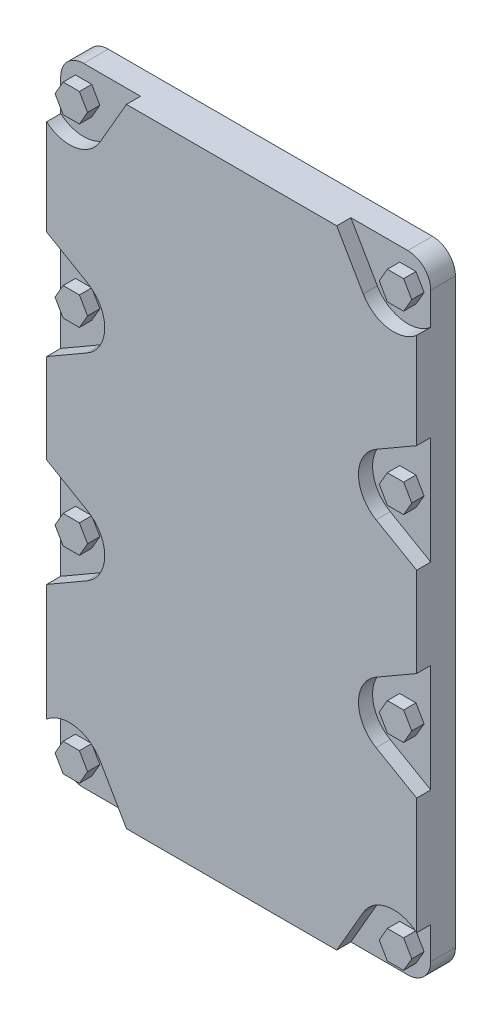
ISO-10303-21;
HEADER;
FILE_DESCRIPTION(('STEP AP214'),'2;1');
FILE_NAME('part.step','',(''),(''),'','','');
FILE_SCHEMA(('AUTOMOTIVE_DESIGN { 1 0 10303 214 1 1 1 1 }'));
ENDSEC;
DATA;
#1=APPLICATION_CONTEXT('core data for automotive mechanical design processes');
#2=APPLICATION_PROTOCOL_DEFINITION('international standard','automotive_design',2000,#1);
#3=PRODUCT_CONTEXT('',#1,'mechanical');
#4=PRODUCT('Part','Part','',(#3));
#5=PRODUCT_RELATED_PRODUCT_CATEGORY('part','',(#4));
#6=PRODUCT_DEFINITION_FORMATION('','',#4);
#7=PRODUCT_DEFINITION_CONTEXT('part definition',#1,'design');
#8=PRODUCT_DEFINITION('design','',#6,#7);
#9=PRODUCT_DEFINITION_SHAPE('','',#8);
#10=(LENGTH_UNIT() NAMED_UNIT(*) SI_UNIT(.MILLI.,.METRE.));
#11=(NAMED_UNIT(*) PLANE_ANGLE_UNIT() SI_UNIT($,.RADIAN.));
#12=(NAMED_UNIT(*) SI_UNIT($,.STERADIAN.) SOLID_ANGLE_UNIT());
#13=UNCERTAINTY_MEASURE_WITH_UNIT(LENGTH_MEASURE(1.E-05),#10,'distance_accuracy_value','');
#14=(GEOMETRIC_REPRESENTATION_CONTEXT(3) GLOBAL_UNCERTAINTY_ASSIGNED_CONTEXT((#13)) GLOBAL_UNIT_ASSIGNED_CONTEXT((#10,
#11,#12)) REPRESENTATION_CONTEXT('',''));
#15=CARTESIAN_POINT('',(0.,0.,0.));
#16=DIRECTION('',(0.,0.,1.));
#17=DIRECTION('',(1.,0.,0.));
#18=AXIS2_PLACEMENT_3D('',#15,#16,#17);
#19=CARTESIAN_POINT('',(362.5,-29.5,85.5));
#20=DIRECTION('',(0.,0.,1.));
#21=DIRECTION('',(1.,0.,0.));
#22=AXIS2_PLACEMENT_3D('',#19,#20,#21);
#23=PLANE('',#22);
#24=DIRECTION('',(1.,0.,0.));
#25=VECTOR('',#24,1.);
#26=CARTESIAN_POINT('',(364.809401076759,-33.5,85.5));
#27=LINE('',#26,#25);
#28=CARTESIAN_POINT('',(364.809401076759,-33.5,85.5));
#29=VERTEX_POINT('',#28);
#30=CARTESIAN_POINT('',(360.190598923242,-33.5000000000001,85.5));
#31=VERTEX_POINT('',#30);
#32=EDGE_CURVE('E972',#29,#31,#27,.F.);
#33=ORIENTED_EDGE('',*,*,#32,.F.);
#34=DIRECTION('',(0.5,0.866025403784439,0.));
#35=VECTOR('',#34,1.);
#36=CARTESIAN_POINT('',(367.118802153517,-29.5,85.5));
#37=LINE('',#36,#35);
#38=CARTESIAN_POINT('',(367.118802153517,-29.5,85.5));
#39=VERTEX_POINT('',#38);
#40=EDGE_CURVE('E973',#39,#29,#37,.F.);
#41=ORIENTED_EDGE('',*,*,#40,.F.);
#42=DIRECTION('',(-0.5,0.866025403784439,0.));
#43=VECTOR('',#42,1.);
#44=CARTESIAN_POINT('',(364.809401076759,-25.5000000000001,85.5));
#45=LINE('',#44,#43);
#46=CARTESIAN_POINT('',(364.809401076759,-25.5000000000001,85.5));
#47=VERTEX_POINT('',#46);
#48=EDGE_CURVE('E968',#47,#39,#45,.F.);
#49=ORIENTED_EDGE('',*,*,#48,.F.);
#50=DIRECTION('',(1.,0.,0.));
#51=VECTOR('',#50,1.);
#52=CARTESIAN_POINT('',(360.190598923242,-25.5,85.5));
#53=LINE('',#52,#51);
#54=CARTESIAN_POINT('',(360.190598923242,-25.5,85.5));
#55=VERTEX_POINT('',#54);
#56=EDGE_CURVE('E1001',#55,#47,#53,.T.);
#57=ORIENTED_EDGE('',*,*,#56,.F.);
#58=DIRECTION('',(-0.5,-0.866025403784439,0.));
#59=VECTOR('',#58,1.);
#60=CARTESIAN_POINT('',(357.881197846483,-29.5,85.5));
#61=LINE('',#60,#59);
#62=CARTESIAN_POINT('',(357.881197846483,-29.5,85.5));
#63=VERTEX_POINT('',#62);
#64=EDGE_CURVE('E1002',#63,#55,#61,.F.);
#65=ORIENTED_EDGE('',*,*,#64,.F.);
#66=DIRECTION('',(0.5,-0.866025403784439,0.));
#67=VECTOR('',#66,1.);
#68=CARTESIAN_POINT('',(360.190598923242,-33.5000000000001,85.5));
#69=LINE('',#68,#67);
#70=EDGE_CURVE('E983',#31,#63,#69,.F.);
#71=ORIENTED_EDGE('',*,*,#70,.F.);
#72=EDGE_LOOP('',(#33,#41,#49,#57,#65,#71));
#73=FACE_BOUND('',#72,.T.);
#74=ADVANCED_FACE('F16',(#73),#23,.T.);
#75=CARTESIAN_POINT('',(362.5,26.5,85.5));
#76=DIRECTION('',(0.,0.,1.));
#77=DIRECTION('',(1.,0.,0.));
#78=AXIS2_PLACEMENT_3D('',#75,#76,#77);
#79=PLANE('',#78);
#80=DIRECTION('',(1.,0.,0.));
#81=VECTOR('',#80,1.);
#82=CARTESIAN_POINT('',(364.809401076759,22.5,85.4999999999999));
#83=LINE('',#82,#81);
#84=CARTESIAN_POINT('',(364.809401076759,22.5,85.4999999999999));
#85=VERTEX_POINT('',#84);
#86=CARTESIAN_POINT('',(360.190598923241,22.5,85.5));
#87=VERTEX_POINT('',#86);
#88=EDGE_CURVE('E1026',#85,#87,#83,.F.);
#89=ORIENTED_EDGE('',*,*,#88,.F.);
#90=DIRECTION('',(0.5,0.866025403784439,0.));
#91=VECTOR('',#90,1.);
#92=CARTESIAN_POINT('',(367.118802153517,26.5,85.5000000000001));
#93=LINE('',#92,#91);
#94=CARTESIAN_POINT('',(367.118802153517,26.5,85.5000000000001));
#95=VERTEX_POINT('',#94);
#96=EDGE_CURVE('E1022',#95,#85,#93,.F.);
#97=ORIENTED_EDGE('',*,*,#96,.F.);
#98=DIRECTION('',(-0.5,0.866025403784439,0.));
#99=VECTOR('',#98,1.);
#100=CARTESIAN_POINT('',(364.809401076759,30.5,85.5));
#101=LINE('',#100,#99);
#102=CARTESIAN_POINT('',(364.809401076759,30.5,85.5));
#103=VERTEX_POINT('',#102);
#104=EDGE_CURVE('E1011',#103,#95,#101,.F.);
#105=ORIENTED_EDGE('',*,*,#104,.F.);
#106=DIRECTION('',(1.,0.,0.));
#107=VECTOR('',#106,1.);
#108=CARTESIAN_POINT('',(360.190598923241,30.5,85.5));
#109=LINE('',#108,#107);
#110=CARTESIAN_POINT('',(360.190598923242,30.5,85.5));
#111=VERTEX_POINT('',#110);
#112=EDGE_CURVE('E1044',#111,#103,#109,.T.);
#113=ORIENTED_EDGE('',*,*,#112,.F.);
#114=DIRECTION('',(-0.5,-0.866025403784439,0.));
#115=VECTOR('',#114,1.);
#116=CARTESIAN_POINT('',(357.881197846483,26.5,85.5));
#117=LINE('',#116,#115);
#118=CARTESIAN_POINT('',(357.881197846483,26.5,85.5));
#119=VERTEX_POINT('',#118);
#120=EDGE_CURVE('E1038',#119,#111,#117,.F.);
#121=ORIENTED_EDGE('',*,*,#120,.F.);
#122=DIRECTION('',(0.5,-0.866025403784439,0.));
#123=VECTOR('',#122,1.);
#124=CARTESIAN_POINT('',(360.190598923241,22.5,85.5));
#125=LINE('',#124,#123);
#126=EDGE_CURVE('E1032',#87,#119,#125,.F.);
#127=ORIENTED_EDGE('',*,*,#126,.F.);
#128=EDGE_LOOP('',(#89,#97,#105,#113,#121,#127));
#129=FACE_BOUND('',#128,.T.);
#130=ADVANCED_FACE('F1384',(#129),#79,.T.);
#131=CARTESIAN_POINT('',(362.5,76.5,85.5));
#132=DIRECTION('',(0.,0.,1.));
#133=DIRECTION('',(1.,0.,0.));
#134=AXIS2_PLACEMENT_3D('',#131,#132,#133);
#135=PLANE('',#134);
#136=DIRECTION('',(1.,0.,0.));
#137=VECTOR('',#136,1.);
#138=CARTESIAN_POINT('',(364.809401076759,72.5,85.5));
#139=LINE('',#138,#137);
#140=CARTESIAN_POINT('',(364.809401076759,72.5,85.5));
#141=VERTEX_POINT('',#140);
#142=CARTESIAN_POINT('',(360.190598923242,72.5,85.5));
#143=VERTEX_POINT('',#142);
#144=EDGE_CURVE('E1061',#141,#143,#139,.F.);
#145=ORIENTED_EDGE('',*,*,#144,.F.);
#146=DIRECTION('',(0.5,0.866025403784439,0.));
#147=VECTOR('',#146,1.);
#148=CARTESIAN_POINT('',(367.118802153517,76.5,85.5));
#149=LINE('',#148,#147);
#150=CARTESIAN_POINT('',(367.118802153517,76.5,85.5));
#151=VERTEX_POINT('',#150);
#152=EDGE_CURVE('E1057',#151,#141,#149,.F.);
#153=ORIENTED_EDGE('',*,*,#152,.F.);
#154=DIRECTION('',(-0.5,0.866025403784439,0.));
#155=VECTOR('',#154,1.);
#156=CARTESIAN_POINT('',(364.809401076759,80.5,85.5000000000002));
#157=LINE('',#156,#155);
#158=CARTESIAN_POINT('',(364.809401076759,80.5,85.5000000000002));
#159=VERTEX_POINT('',#158);
#160=EDGE_CURVE('E1050',#159,#151,#157,.F.);
#161=ORIENTED_EDGE('',*,*,#160,.F.);
#162=DIRECTION('',(1.,0.,0.));
#163=VECTOR('',#162,1.);
#164=CARTESIAN_POINT('',(360.190598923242,80.5000000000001,85.5000000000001));
#165=LINE('',#164,#163);
#166=CARTESIAN_POINT('',(360.190598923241,80.5,85.5000000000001));
#167=VERTEX_POINT('',#166);
#168=EDGE_CURVE('E1079',#167,#159,#165,.T.);
#169=ORIENTED_EDGE('',*,*,#168,.F.);
#170=DIRECTION('',(-0.5,-0.866025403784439,0.));
#171=VECTOR('',#170,1.);
#172=CARTESIAN_POINT('',(357.881197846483,76.5,85.5));
#173=LINE('',#172,#171);
#174=CARTESIAN_POINT('',(357.881197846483,76.5,85.5));
#175=VERTEX_POINT('',#174);
#176=EDGE_CURVE('E1073',#175,#167,#173,.F.);
#177=ORIENTED_EDGE('',*,*,#176,.F.);
#178=DIRECTION('',(0.5,-0.866025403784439,0.));
#179=VECTOR('',#178,1.);
#180=CARTESIAN_POINT('',(360.190598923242,72.5,85.5));
#181=LINE('',#180,#179);
#182=EDGE_CURVE('E1067',#143,#175,#181,.F.);
#183=ORIENTED_EDGE('',*,*,#182,.F.);
#184=EDGE_LOOP('',(#145,#153,#161,#169,#177,#183));
#185=FACE_BOUND('',#184,.T.);
#186=ADVANCED_FACE('F1390',(#185),#135,.T.);
#187=CARTESIAN_POINT('',(270.5,76.5,85.4999999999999));
#188=DIRECTION('',(0.,0.,1.));
#189=DIRECTION('',(1.,0.,0.));
#190=AXIS2_PLACEMENT_3D('',#187,#188,#189);
#191=PLANE('',#190);
#192=DIRECTION('',(1.,0.,0.));
#193=VECTOR('',#192,1.);
#194=CARTESIAN_POINT('',(272.809401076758,72.5,85.5));
#195=LINE('',#194,#193);
#196=CARTESIAN_POINT('',(272.809401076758,72.5,85.5));
#197=VERTEX_POINT('',#196);
#198=CARTESIAN_POINT('',(268.190598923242,72.5,85.5));
#199=VERTEX_POINT('',#198);
#200=EDGE_CURVE('E1096',#197,#199,#195,.F.);
#201=ORIENTED_EDGE('',*,*,#200,.F.);
#202=DIRECTION('',(0.5,0.866025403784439,0.));
#203=VECTOR('',#202,1.);
#204=CARTESIAN_POINT('',(275.118802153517,76.5,85.4999999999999));
#205=LINE('',#204,#203);
#206=CARTESIAN_POINT('',(275.118802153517,76.5,85.4999999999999));
#207=VERTEX_POINT('',#206);
#208=EDGE_CURVE('E1092',#207,#197,#205,.F.);
#209=ORIENTED_EDGE('',*,*,#208,.F.);
#210=DIRECTION('',(-0.5,0.866025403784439,0.));
#211=VECTOR('',#210,1.);
#212=CARTESIAN_POINT('',(272.809401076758,80.5,85.5));
#213=LINE('',#212,#211);
#214=CARTESIAN_POINT('',(272.809401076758,80.5,85.5));
#215=VERTEX_POINT('',#214);
#216=EDGE_CURVE('E1085',#215,#207,#213,.F.);
#217=ORIENTED_EDGE('',*,*,#216,.F.);
#218=DIRECTION('',(1.,0.,0.));
#219=VECTOR('',#218,1.);
#220=CARTESIAN_POINT('',(268.190598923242,80.5,85.5));
#221=LINE('',#220,#219);
#222=CARTESIAN_POINT('',(268.190598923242,80.5,85.5));
#223=VERTEX_POINT('',#222);
#224=EDGE_CURVE('E1114',#223,#215,#221,.T.);
#225=ORIENTED_EDGE('',*,*,#224,.F.);
#226=DIRECTION('',(-0.5,-0.866025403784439,0.));
#227=VECTOR('',#226,1.);
#228=CARTESIAN_POINT('',(265.881197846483,76.5,85.4999999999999));
#229=LINE('',#228,#227);
#230=CARTESIAN_POINT('',(265.881197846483,76.5,85.4999999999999));
#231=VERTEX_POINT('',#230);
#232=EDGE_CURVE('E1108',#231,#223,#229,.F.);
#233=ORIENTED_EDGE('',*,*,#232,.F.);
#234=DIRECTION('',(0.5,-0.866025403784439,0.));
#235=VECTOR('',#234,1.);
#236=CARTESIAN_POINT('',(268.190598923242,72.5,85.5));
#237=LINE('',#236,#235);
#238=EDGE_CURVE('E1102',#199,#231,#237,.F.);
#239=ORIENTED_EDGE('',*,*,#238,.F.);
#240=EDGE_LOOP('',(#201,#209,#217,#225,#233,#239));
#241=FACE_BOUND('',#240,.T.);
#242=ADVANCED_FACE('F1694',(#241),#191,.T.);
#243=CARTESIAN_POINT('',(270.5,-29.5,85.4999999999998));
#244=DIRECTION('',(0.,0.,1.));
#245=DIRECTION('',(1.,0.,0.));
#246=AXIS2_PLACEMENT_3D('',#243,#244,#245);
#247=PLANE('',#246);
#248=DIRECTION('',(1.,0.,0.));
#249=VECTOR('',#248,1.);
#250=CARTESIAN_POINT('',(272.809401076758,-33.5,85.5));
#251=LINE('',#250,#249);
#252=CARTESIAN_POINT('',(272.809401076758,-33.5,85.5));
#253=VERTEX_POINT('',#252);
#254=CARTESIAN_POINT('',(268.190598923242,-33.5,85.4999999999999));
#255=VERTEX_POINT('',#254);
#256=EDGE_CURVE('E1131',#253,#255,#251,.F.);
#257=ORIENTED_EDGE('',*,*,#256,.F.);
#258=DIRECTION('',(0.5,0.866025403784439,0.));
#259=VECTOR('',#258,1.);
#260=CARTESIAN_POINT('',(275.118802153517,-29.5,85.4999999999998));
#261=LINE('',#260,#259);
#262=CARTESIAN_POINT('',(275.118802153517,-29.5,85.4999999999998));
#263=VERTEX_POINT('',#262);
#264=EDGE_CURVE('E1127',#263,#253,#261,.F.);
#265=ORIENTED_EDGE('',*,*,#264,.F.);
#266=DIRECTION('',(-0.5,0.866025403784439,0.));
#267=VECTOR('',#266,1.);
#268=CARTESIAN_POINT('',(272.809401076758,-25.5,85.5));
#269=LINE('',#268,#267);
#270=CARTESIAN_POINT('',(272.809401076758,-25.5,85.5));
#271=VERTEX_POINT('',#270);
#272=EDGE_CURVE('E1120',#271,#263,#269,.F.);
#273=ORIENTED_EDGE('',*,*,#272,.F.);
#274=DIRECTION('',(1.,0.,0.));
#275=VECTOR('',#274,1.);
#276=CARTESIAN_POINT('',(268.190598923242,-25.5,85.5));
#277=LINE('',#276,#275);
#278=CARTESIAN_POINT('',(268.190598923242,-25.5,85.5));
#279=VERTEX_POINT('',#278);
#280=EDGE_CURVE('E1149',#279,#271,#277,.T.);
#281=ORIENTED_EDGE('',*,*,#280,.F.);
#282=DIRECTION('',(-0.5,-0.866025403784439,0.));
#283=VECTOR('',#282,1.);
#284=CARTESIAN_POINT('',(265.881197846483,-29.5,85.4999999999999));
#285=LINE('',#284,#283);
#286=CARTESIAN_POINT('',(265.881197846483,-29.5,85.4999999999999));
#287=VERTEX_POINT('',#286);
#288=EDGE_CURVE('E1143',#287,#279,#285,.F.);
#289=ORIENTED_EDGE('',*,*,#288,.F.);
#290=DIRECTION('',(0.5,-0.866025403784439,0.));
#291=VECTOR('',#290,1.);
#292=CARTESIAN_POINT('',(268.190598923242,-33.5,85.4999999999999));
#293=LINE('',#292,#291);
#294=EDGE_CURVE('E1137',#255,#287,#293,.F.);
#295=ORIENTED_EDGE('',*,*,#294,.F.);
#296=EDGE_LOOP('',(#257,#265,#273,#281,#289,#295));
#297=FACE_BOUND('',#296,.T.);
#298=ADVANCED_FACE('F1690',(#297),#247,.T.);
#299=CARTESIAN_POINT('',(270.5,26.5,85.5));
#300=DIRECTION('',(0.,0.,1.));
#301=DIRECTION('',(1.,0.,0.));
#302=AXIS2_PLACEMENT_3D('',#299,#300,#301);
#303=PLANE('',#302);
#304=DIRECTION('',(1.,0.,0.));
#305=VECTOR('',#304,1.);
#306=CARTESIAN_POINT('',(272.809401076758,22.5,85.5));
#307=LINE('',#306,#305);
#308=CARTESIAN_POINT('',(272.809401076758,22.5,85.5));
#309=VERTEX_POINT('',#308);
#310=CARTESIAN_POINT('',(268.190598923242,22.5,85.5));
#311=VERTEX_POINT('',#310);
#312=EDGE_CURVE('E1166',#309,#311,#307,.F.);
#313=ORIENTED_EDGE('',*,*,#312,.F.);
#314=DIRECTION('',(0.5,0.866025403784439,0.));
#315=VECTOR('',#314,1.);
#316=CARTESIAN_POINT('',(275.118802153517,26.5,85.5));
#317=LINE('',#316,#315);
#318=CARTESIAN_POINT('',(275.118802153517,26.5,85.5));
#319=VERTEX_POINT('',#318);
#320=EDGE_CURVE('E1162',#319,#309,#317,.F.);
#321=ORIENTED_EDGE('',*,*,#320,.F.);
#322=DIRECTION('',(-0.5,0.866025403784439,0.));
#323=VECTOR('',#322,1.);
#324=CARTESIAN_POINT('',(272.809401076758,30.5,85.5));
#325=LINE('',#324,#323);
#326=CARTESIAN_POINT('',(272.809401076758,30.5,85.5));
#327=VERTEX_POINT('',#326);
#328=EDGE_CURVE('E1155',#327,#319,#325,.F.);
#329=ORIENTED_EDGE('',*,*,#328,.F.);
#330=DIRECTION('',(1.,0.,0.));
#331=VECTOR('',#330,1.);
#332=CARTESIAN_POINT('',(268.190598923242,30.5,85.5));
#333=LINE('',#332,#331);
#334=CARTESIAN_POINT('',(268.190598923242,30.5,85.5));
#335=VERTEX_POINT('',#334);
#336=EDGE_CURVE('E1184',#335,#327,#333,.T.);
#337=ORIENTED_EDGE('',*,*,#336,.F.);
#338=DIRECTION('',(-0.5,-0.866025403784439,0.));
#339=VECTOR('',#338,1.);
#340=CARTESIAN_POINT('',(265.881197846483,26.5,85.5));
#341=LINE('',#340,#339);
#342=CARTESIAN_POINT('',(265.881197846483,26.5,85.5));
#343=VERTEX_POINT('',#342);
#344=EDGE_CURVE('E1178',#343,#335,#341,.F.);
#345=ORIENTED_EDGE('',*,*,#344,.F.);
#346=DIRECTION('',(0.5,-0.866025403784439,0.));
#347=VECTOR('',#346,1.);
#348=CARTESIAN_POINT('',(268.190598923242,22.5,85.5));
#349=LINE('',#348,#347);
#350=EDGE_CURVE('E1172',#311,#343,#349,.F.);
#351=ORIENTED_EDGE('',*,*,#350,.F.);
#352=EDGE_LOOP('',(#313,#321,#329,#337,#345,#351));
#353=FACE_BOUND('',#352,.T.);
#354=ADVANCED_FACE('F1686',(#353),#303,.T.);
#355=CARTESIAN_POINT('',(362.5,-85.5,85.5));
#356=DIRECTION('',(0.,0.,1.));
#357=DIRECTION('',(1.,0.,0.));
#358=AXIS2_PLACEMENT_3D('',#355,#356,#357);
#359=PLANE('',#358);
#360=DIRECTION('',(1.,0.,0.));
#361=VECTOR('',#360,1.);
#362=CARTESIAN_POINT('',(364.809401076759,-89.5,85.5));
#363=LINE('',#362,#361);
#364=CARTESIAN_POINT('',(364.809401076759,-89.5,85.5));
#365=VERTEX_POINT('',#364);
#366=CARTESIAN_POINT('',(360.190598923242,-89.5,85.5));
#367=VERTEX_POINT('',#366);
#368=EDGE_CURVE('E1201',#365,#367,#363,.F.);
#369=ORIENTED_EDGE('',*,*,#368,.F.);
#370=DIRECTION('',(0.5,0.866025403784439,0.));
#371=VECTOR('',#370,1.);
#372=CARTESIAN_POINT('',(367.118802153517,-85.5,85.5));
#373=LINE('',#372,#371);
#374=CARTESIAN_POINT('',(367.118802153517,-85.5,85.5));
#375=VERTEX_POINT('',#374);
#376=EDGE_CURVE('E1197',#375,#365,#373,.F.);
#377=ORIENTED_EDGE('',*,*,#376,.F.);
#378=DIRECTION('',(-0.5,0.866025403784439,0.));
#379=VECTOR('',#378,1.);
#380=CARTESIAN_POINT('',(364.809401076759,-81.5,85.5));
#381=LINE('',#380,#379);
#382=CARTESIAN_POINT('',(364.809401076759,-81.5,85.5));
#383=VERTEX_POINT('',#382);
#384=EDGE_CURVE('E1190',#383,#375,#381,.F.);
#385=ORIENTED_EDGE('',*,*,#384,.F.);
#386=DIRECTION('',(1.,0.,0.));
#387=VECTOR('',#386,1.);
#388=CARTESIAN_POINT('',(360.190598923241,-81.5,85.5));
#389=LINE('',#388,#387);
#390=CARTESIAN_POINT('',(360.190598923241,-81.5,85.5));
#391=VERTEX_POINT('',#390);
#392=EDGE_CURVE('E1219',#391,#383,#389,.T.);
#393=ORIENTED_EDGE('',*,*,#392,.F.);
#394=DIRECTION('',(-0.5,-0.866025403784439,0.));
#395=VECTOR('',#394,1.);
#396=CARTESIAN_POINT('',(357.881197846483,-85.5,85.5));
#397=LINE('',#396,#395);
#398=CARTESIAN_POINT('',(357.881197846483,-85.5,85.5));
#399=VERTEX_POINT('',#398);
#400=EDGE_CURVE('E1213',#399,#391,#397,.F.);
#401=ORIENTED_EDGE('',*,*,#400,.F.);
#402=DIRECTION('',(0.5,-0.866025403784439,0.));
#403=VECTOR('',#402,1.);
#404=CARTESIAN_POINT('',(360.190598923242,-89.5,85.5));
#405=LINE('',#404,#403);
#406=EDGE_CURVE('E1207',#367,#399,#405,.F.);
#407=ORIENTED_EDGE('',*,*,#406,.F.);
#408=EDGE_LOOP('',(#369,#377,#385,#393,#401,#407));
#409=FACE_BOUND('',#408,.T.);
#410=ADVANCED_FACE('F1683',(#409),#359,.T.);
#411=CARTESIAN_POINT('',(270.5,-85.5,85.5));
#412=DIRECTION('',(0.,0.,1.));
#413=DIRECTION('',(1.,0.,0.));
#414=AXIS2_PLACEMENT_3D('',#411,#412,#413);
#415=PLANE('',#414);
#416=DIRECTION('',(1.,0.,0.));
#417=VECTOR('',#416,1.);
#418=CARTESIAN_POINT('',(272.809401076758,-89.5000000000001,85.4999999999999));
#419=LINE('',#418,#417);
#420=CARTESIAN_POINT('',(272.809401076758,-89.5000000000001,85.4999999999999));
#421=VERTEX_POINT('',#420);
#422=CARTESIAN_POINT('',(268.190598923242,-89.5,85.5));
#423=VERTEX_POINT('',#422);
#424=EDGE_CURVE('E1236',#421,#423,#419,.F.);
#425=ORIENTED_EDGE('',*,*,#424,.F.);
#426=DIRECTION('',(0.5,0.866025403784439,0.));
#427=VECTOR('',#426,1.);
#428=CARTESIAN_POINT('',(275.118802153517,-85.5,85.5));
#429=LINE('',#428,#427);
#430=CARTESIAN_POINT('',(275.118802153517,-85.5,85.5));
#431=VERTEX_POINT('',#430);
#432=EDGE_CURVE('E1232',#431,#421,#429,.F.);
#433=ORIENTED_EDGE('',*,*,#432,.F.);
#434=DIRECTION('',(-0.5,0.866025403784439,0.));
#435=VECTOR('',#434,1.);
#436=CARTESIAN_POINT('',(272.809401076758,-81.5,85.5));
#437=LINE('',#436,#435);
#438=CARTESIAN_POINT('',(272.809401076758,-81.5,85.5));
#439=VERTEX_POINT('',#438);
#440=EDGE_CURVE('E1225',#439,#431,#437,.F.);
#441=ORIENTED_EDGE('',*,*,#440,.F.);
#442=DIRECTION('',(1.,0.,0.));
#443=VECTOR('',#442,1.);
#444=CARTESIAN_POINT('',(268.190598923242,-81.5,85.5));
#445=LINE('',#444,#443);
#446=CARTESIAN_POINT('',(268.190598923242,-81.5,85.5));
#447=VERTEX_POINT('',#446);
#448=EDGE_CURVE('E1254',#447,#439,#445,.T.);
#449=ORIENTED_EDGE('',*,*,#448,.F.);
#450=DIRECTION('',(-0.5,-0.866025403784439,0.));
#451=VECTOR('',#450,1.);
#452=CARTESIAN_POINT('',(265.881197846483,-85.5,85.5));
#453=LINE('',#452,#451);
#454=CARTESIAN_POINT('',(265.881197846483,-85.5,85.5));
#455=VERTEX_POINT('',#454);
#456=EDGE_CURVE('E1248',#455,#447,#453,.F.);
#457=ORIENTED_EDGE('',*,*,#456,.F.);
#458=DIRECTION('',(0.5,-0.866025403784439,0.));
#459=VECTOR('',#458,1.);
#460=CARTESIAN_POINT('',(268.190598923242,-89.5,85.5));
#461=LINE('',#460,#459);
#462=EDGE_CURVE('E1242',#423,#455,#461,.F.);
#463=ORIENTED_EDGE('',*,*,#462,.F.);
#464=EDGE_LOOP('',(#425,#433,#441,#449,#457,#463));
#465=FACE_BOUND('',#464,.T.);
#466=ADVANCED_FACE('F1274',(#465),#415,.T.);
#467=CARTESIAN_POINT('',(364.809401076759,-25.5,82.));
#468=DIRECTION('',(0.866025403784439,0.5,0.));
#469=DIRECTION('',(-0.5,0.866025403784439,0.));
#470=AXIS2_PLACEMENT_3D('',#467,#468,#469);
#471=PLANE('',#470);
#472=DIRECTION('',(0.499999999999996,-0.866025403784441,0.));
#473=VECTOR('',#472,1.);
#474=CARTESIAN_POINT('',(364.809401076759,-25.5,82.));
#475=LINE('',#474,#473);
#476=CARTESIAN_POINT('',(364.809401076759,-25.5,82.));
#477=VERTEX_POINT('',#476);
#478=CARTESIAN_POINT('',(367.118802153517,-29.5000000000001,81.9999999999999));
#479=VERTEX_POINT('',#478);
#480=EDGE_CURVE('E480',#477,#479,#475,.T.);
#481=ORIENTED_EDGE('',*,*,#480,.F.);
#482=DIRECTION('',(0.,0.,1.));
#483=VECTOR('',#482,1.);
#484=CARTESIAN_POINT('',(364.809401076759,-25.5,82.));
#485=LINE('',#484,#483);
#486=EDGE_CURVE('E1012',#47,#477,#485,.F.);
#487=ORIENTED_EDGE('',*,*,#486,.F.);
#488=ORIENTED_EDGE('',*,*,#48,.T.);
#489=DIRECTION('',(0.,0.,1.));
#490=VECTOR('',#489,1.);
#491=CARTESIAN_POINT('',(367.118802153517,-29.5000000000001,81.9999999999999));
#492=LINE('',#491,#490);
#493=EDGE_CURVE('E964',#479,#39,#492,.T.);
#494=ORIENTED_EDGE('',*,*,#493,.F.);
#495=EDGE_LOOP('',(#481,#487,#488,#494));
#496=FACE_BOUND('',#495,.T.);
#497=ADVANCED_FACE('F965',(#496),#471,.T.);
#498=CARTESIAN_POINT('',(367.118802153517,-29.5000000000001,81.9999999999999));
#499=DIRECTION('',(0.866025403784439,-0.5,0.));
#500=DIRECTION('',(0.5,0.866025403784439,0.));
#501=AXIS2_PLACEMENT_3D('',#498,#499,#500);
#502=PLANE('',#501);
#503=DIRECTION('',(-0.499999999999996,-0.866025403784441,0.));
#504=VECTOR('',#503,1.);
#505=CARTESIAN_POINT('',(367.118802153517,-29.5000000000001,81.9999999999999));
#506=LINE('',#505,#504);
#507=CARTESIAN_POINT('',(364.809401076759,-33.5000000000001,82.));
#508=VERTEX_POINT('',#507);
#509=EDGE_CURVE('E953',#479,#508,#506,.T.);
#510=ORIENTED_EDGE('',*,*,#509,.F.);
#511=ORIENTED_EDGE('',*,*,#493,.T.);
#512=ORIENTED_EDGE('',*,*,#40,.T.);
#513=DIRECTION('',(0.,0.,-1.));
#514=VECTOR('',#513,1.);
#515=CARTESIAN_POINT('',(364.809401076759,-33.5000000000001,82.));
#516=LINE('',#515,#514);
#517=EDGE_CURVE('E977',#508,#29,#516,.F.);
#518=ORIENTED_EDGE('',*,*,#517,.F.);
#519=EDGE_LOOP('',(#510,#511,#512,#518));
#520=FACE_BOUND('',#519,.T.);
#521=ADVANCED_FACE('F975',(#520),#502,.T.);
#522=CARTESIAN_POINT('',(364.809401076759,-33.5000000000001,82.));
#523=DIRECTION('',(0.,-1.,0.));
#524=DIRECTION('',(0.,0.,-1.));
#525=AXIS2_PLACEMENT_3D('',#522,#523,#524);
#526=PLANE('',#525);
#527=DIRECTION('',(1.,0.,0.));
#528=VECTOR('',#527,1.);
#529=CARTESIAN_POINT('',(363.171082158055,-33.5000000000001,82.));
#530=LINE('',#529,#528);
#531=CARTESIAN_POINT('',(360.190598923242,-33.5000000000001,82.));
#532=VERTEX_POINT('',#531);
#533=EDGE_CURVE('E951',#508,#532,#530,.F.);
#534=ORIENTED_EDGE('',*,*,#533,.F.);
#535=ORIENTED_EDGE('',*,*,#517,.T.);
#536=ORIENTED_EDGE('',*,*,#32,.T.);
#537=DIRECTION('',(0.,0.,1.));
#538=VECTOR('',#537,1.);
#539=CARTESIAN_POINT('',(360.190598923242,-33.5000000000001,82.));
#540=LINE('',#539,#538);
#541=EDGE_CURVE('E988',#532,#31,#540,.T.);
#542=ORIENTED_EDGE('',*,*,#541,.F.);
#543=EDGE_LOOP('',(#534,#535,#536,#542));
#544=FACE_BOUND('',#543,.T.);
#545=ADVANCED_FACE('F986',(#544),#526,.T.);
#546=CARTESIAN_POINT('',(360.190598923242,-33.5000000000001,82.));
#547=DIRECTION('',(-0.866025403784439,-0.5,0.));
#548=DIRECTION('',(0.5,-0.866025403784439,0.));
#549=AXIS2_PLACEMENT_3D('',#546,#547,#548);
#550=PLANE('',#549);
#551=DIRECTION('',(-0.499999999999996,0.866025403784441,0.));
#552=VECTOR('',#551,1.);
#553=CARTESIAN_POINT('',(360.190598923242,-33.5000000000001,82.));
#554=LINE('',#553,#552);
#555=CARTESIAN_POINT('',(357.881197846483,-29.5,81.9999999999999));
#556=VERTEX_POINT('',#555);
#557=EDGE_CURVE('E945',#532,#556,#554,.T.);
#558=ORIENTED_EDGE('',*,*,#557,.F.);
#559=ORIENTED_EDGE('',*,*,#541,.T.);
#560=ORIENTED_EDGE('',*,*,#70,.T.);
#561=DIRECTION('',(0.,0.,1.));
#562=VECTOR('',#561,1.);
#563=CARTESIAN_POINT('',(357.881197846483,-29.5,81.9999999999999));
#564=LINE('',#563,#562);
#565=EDGE_CURVE('E994',#556,#63,#564,.T.);
#566=ORIENTED_EDGE('',*,*,#565,.F.);
#567=EDGE_LOOP('',(#558,#559,#560,#566));
#568=FACE_BOUND('',#567,.T.);
#569=ADVANCED_FACE('F995',(#568),#550,.T.);
#570=CARTESIAN_POINT('',(357.881197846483,-29.5,81.9999999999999));
#571=DIRECTION('',(-0.866025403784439,0.5,0.));
#572=DIRECTION('',(-0.5,-0.866025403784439,0.));
#573=AXIS2_PLACEMENT_3D('',#570,#571,#572);
#574=PLANE('',#573);
#575=DIRECTION('',(0.499999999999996,0.866025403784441,0.));
#576=VECTOR('',#575,1.);
#577=CARTESIAN_POINT('',(357.881197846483,-29.5,81.9999999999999));
#578=LINE('',#577,#576);
#579=CARTESIAN_POINT('',(360.190598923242,-25.5,82.));
#580=VERTEX_POINT('',#579);
#581=EDGE_CURVE('E214',#556,#580,#578,.T.);
#582=ORIENTED_EDGE('',*,*,#581,.F.);
#583=ORIENTED_EDGE('',*,*,#565,.T.);
#584=ORIENTED_EDGE('',*,*,#64,.T.);
#585=DIRECTION('',(0.,0.,1.));
#586=VECTOR('',#585,1.);
#587=CARTESIAN_POINT('',(360.190598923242,-25.5,82.));
#588=LINE('',#587,#586);
#589=EDGE_CURVE('E1006',#580,#55,#588,.T.);
#590=ORIENTED_EDGE('',*,*,#589,.F.);
#591=EDGE_LOOP('',(#582,#583,#584,#590));
#592=FACE_BOUND('',#591,.T.);
#593=ADVANCED_FACE('F1004',(#592),#574,.T.);
#594=CARTESIAN_POINT('',(360.190598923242,-25.5,82.));
#595=DIRECTION('',(0.,1.,0.));
#596=DIRECTION('',(0.,0.,1.));
#597=AXIS2_PLACEMENT_3D('',#594,#595,#596);
#598=PLANE('',#597);
#599=DIRECTION('',(1.,0.,0.));
#600=VECTOR('',#599,1.);
#601=CARTESIAN_POINT('',(363.171082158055,-25.5000000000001,82.));
#602=LINE('',#601,#600);
#603=EDGE_CURVE('E941',#580,#477,#602,.T.);
#604=ORIENTED_EDGE('',*,*,#603,.F.);
#605=ORIENTED_EDGE('',*,*,#589,.T.);
#606=ORIENTED_EDGE('',*,*,#56,.T.);
#607=ORIENTED_EDGE('',*,*,#486,.T.);
#608=EDGE_LOOP('',(#604,#605,#606,#607));
#609=FACE_BOUND('',#608,.T.);
#610=ADVANCED_FACE('F1014',(#609),#598,.T.);
#611=CARTESIAN_POINT('',(364.809401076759,30.4999999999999,82.));
#612=DIRECTION('',(0.866025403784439,0.5,0.));
#613=DIRECTION('',(-0.5,0.866025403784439,0.));
#614=AXIS2_PLACEMENT_3D('',#611,#612,#613);
#615=PLANE('',#614);
#616=DIRECTION('',(0.499999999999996,-0.866025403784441,0.));
#617=VECTOR('',#616,1.);
#618=CARTESIAN_POINT('',(364.809401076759,30.4999999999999,82.));
#619=LINE('',#618,#617);
#620=CARTESIAN_POINT('',(364.809401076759,30.4999999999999,82.));
#621=VERTEX_POINT('',#620);
#622=CARTESIAN_POINT('',(367.118802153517,26.5,82.0000000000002));
#623=VERTEX_POINT('',#622);
#624=EDGE_CURVE('E474',#621,#623,#619,.T.);
#625=ORIENTED_EDGE('',*,*,#624,.F.);
#626=DIRECTION('',(0.,0.,1.));
#627=VECTOR('',#626,1.);
#628=CARTESIAN_POINT('',(364.809401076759,30.4999999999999,82.));
#629=LINE('',#628,#627);
#630=EDGE_CURVE('E1051',#103,#621,#629,.F.);
#631=ORIENTED_EDGE('',*,*,#630,.F.);
#632=ORIENTED_EDGE('',*,*,#104,.T.);
#633=DIRECTION('',(0.,0.,1.));
#634=VECTOR('',#633,1.);
#635=CARTESIAN_POINT('',(367.118802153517,26.4999999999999,82.0000000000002));
#636=LINE('',#635,#634);
#637=EDGE_CURVE('E1023',#623,#95,#636,.T.);
#638=ORIENTED_EDGE('',*,*,#637,.F.);
#639=EDGE_LOOP('',(#625,#631,#632,#638));
#640=FACE_BOUND('',#639,.T.);
#641=ADVANCED_FACE('F1664',(#640),#615,.T.);
#642=CARTESIAN_POINT('',(367.118802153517,26.4999999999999,82.0000000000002));
#643=DIRECTION('',(0.866025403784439,-0.5,0.));
#644=DIRECTION('',(0.5,0.866025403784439,0.));
#645=AXIS2_PLACEMENT_3D('',#642,#643,#644);
#646=PLANE('',#645);
#647=DIRECTION('',(-0.499999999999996,-0.866025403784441,0.));
#648=VECTOR('',#647,1.);
#649=CARTESIAN_POINT('',(367.118802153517,26.4999999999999,82.0000000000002));
#650=LINE('',#649,#648);
#651=CARTESIAN_POINT('',(364.809401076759,22.4999999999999,82.));
#652=VERTEX_POINT('',#651);
#653=EDGE_CURVE('E617',#623,#652,#650,.T.);
#654=ORIENTED_EDGE('',*,*,#653,.F.);
#655=ORIENTED_EDGE('',*,*,#637,.T.);
#656=ORIENTED_EDGE('',*,*,#96,.T.);
#657=DIRECTION('',(0.,0.,-1.));
#658=VECTOR('',#657,1.);
#659=CARTESIAN_POINT('',(364.809401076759,22.4999999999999,82.));
#660=LINE('',#659,#658);
#661=EDGE_CURVE('E1029',#652,#85,#660,.F.);
#662=ORIENTED_EDGE('',*,*,#661,.F.);
#663=EDGE_LOOP('',(#654,#655,#656,#662));
#664=FACE_BOUND('',#663,.T.);
#665=ADVANCED_FACE('F1660',(#664),#646,.T.);
#666=CARTESIAN_POINT('',(364.809401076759,22.4999999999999,82.));
#667=DIRECTION('',(0.,-1.,0.));
#668=DIRECTION('',(0.,0.,-1.));
#669=AXIS2_PLACEMENT_3D('',#666,#667,#668);
#670=PLANE('',#669);
#671=DIRECTION('',(1.,0.,0.));
#672=VECTOR('',#671,1.);
#673=CARTESIAN_POINT('',(363.171082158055,22.4999999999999,82.));
#674=LINE('',#673,#672);
#675=CARTESIAN_POINT('',(360.190598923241,22.4999999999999,82.));
#676=VERTEX_POINT('',#675);
#677=EDGE_CURVE('E615',#652,#676,#674,.F.);
#678=ORIENTED_EDGE('',*,*,#677,.F.);
#679=ORIENTED_EDGE('',*,*,#661,.T.);
#680=ORIENTED_EDGE('',*,*,#88,.T.);
#681=DIRECTION('',(0.,0.,1.));
#682=VECTOR('',#681,1.);
#683=CARTESIAN_POINT('',(360.190598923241,22.4999999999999,82.));
#684=LINE('',#683,#682);
#685=EDGE_CURVE('E1035',#676,#87,#684,.T.);
#686=ORIENTED_EDGE('',*,*,#685,.F.);
#687=EDGE_LOOP('',(#678,#679,#680,#686));
#688=FACE_BOUND('',#687,.T.);
#689=ADVANCED_FACE('F1656',(#688),#670,.T.);
#690=CARTESIAN_POINT('',(360.190598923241,22.4999999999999,82.));
#691=DIRECTION('',(-0.866025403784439,-0.5,0.));
#692=DIRECTION('',(0.5,-0.866025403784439,0.));
#693=AXIS2_PLACEMENT_3D('',#690,#691,#692);
#694=PLANE('',#693);
#695=DIRECTION('',(-0.499999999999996,0.866025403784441,0.));
#696=VECTOR('',#695,1.);
#697=CARTESIAN_POINT('',(360.190598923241,22.4999999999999,82.));
#698=LINE('',#697,#696);
#699=CARTESIAN_POINT('',(357.881197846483,26.4999999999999,82.));
#700=VERTEX_POINT('',#699);
#701=EDGE_CURVE('E609',#676,#700,#698,.T.);
#702=ORIENTED_EDGE('',*,*,#701,.F.);
#703=ORIENTED_EDGE('',*,*,#685,.T.);
#704=ORIENTED_EDGE('',*,*,#126,.T.);
#705=DIRECTION('',(0.,0.,1.));
#706=VECTOR('',#705,1.);
#707=CARTESIAN_POINT('',(357.881197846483,26.4999999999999,82.));
#708=LINE('',#707,#706);
#709=EDGE_CURVE('E1041',#700,#119,#708,.T.);
#710=ORIENTED_EDGE('',*,*,#709,.F.);
#711=EDGE_LOOP('',(#702,#703,#704,#710));
#712=FACE_BOUND('',#711,.T.);
#713=ADVANCED_FACE('F1652',(#712),#694,.T.);
#714=CARTESIAN_POINT('',(357.881197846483,26.4999999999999,82.));
#715=DIRECTION('',(-0.866025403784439,0.5,0.));
#716=DIRECTION('',(-0.5,-0.866025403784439,0.));
#717=AXIS2_PLACEMENT_3D('',#714,#715,#716);
#718=PLANE('',#717);
#719=DIRECTION('',(0.499999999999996,0.866025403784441,0.));
#720=VECTOR('',#719,1.);
#721=CARTESIAN_POINT('',(357.881197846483,26.4999999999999,82.));
#722=LINE('',#721,#720);
#723=CARTESIAN_POINT('',(360.190598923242,30.4999999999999,82.));
#724=VERTEX_POINT('',#723);
#725=EDGE_CURVE('E604',#700,#724,#722,.T.);
#726=ORIENTED_EDGE('',*,*,#725,.F.);
#727=ORIENTED_EDGE('',*,*,#709,.T.);
#728=ORIENTED_EDGE('',*,*,#120,.T.);
#729=DIRECTION('',(0.,0.,1.));
#730=VECTOR('',#729,1.);
#731=CARTESIAN_POINT('',(360.190598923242,30.4999999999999,82.));
#732=LINE('',#731,#730);
#733=EDGE_CURVE('E1047',#724,#111,#732,.T.);
#734=ORIENTED_EDGE('',*,*,#733,.F.);
#735=EDGE_LOOP('',(#726,#727,#728,#734));
#736=FACE_BOUND('',#735,.T.);
#737=ADVANCED_FACE('F1648',(#736),#718,.T.);
#738=CARTESIAN_POINT('',(360.190598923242,30.4999999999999,82.));
#739=DIRECTION('',(0.,1.,0.));
#740=DIRECTION('',(0.,0.,1.));
#741=AXIS2_PLACEMENT_3D('',#738,#739,#740);
#742=PLANE('',#741);
#743=DIRECTION('',(1.,0.,0.));
#744=VECTOR('',#743,1.);
#745=CARTESIAN_POINT('',(363.171082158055,30.4999999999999,82.));
#746=LINE('',#745,#744);
#747=EDGE_CURVE('E597',#724,#621,#746,.T.);
#748=ORIENTED_EDGE('',*,*,#747,.F.);
#749=ORIENTED_EDGE('',*,*,#733,.T.);
#750=ORIENTED_EDGE('',*,*,#112,.T.);
#751=ORIENTED_EDGE('',*,*,#630,.T.);
#752=EDGE_LOOP('',(#748,#749,#750,#751));
#753=FACE_BOUND('',#752,.T.);
#754=ADVANCED_FACE('F1644',(#753),#742,.T.);
#755=CARTESIAN_POINT('',(364.809401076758,80.4999999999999,82.0000000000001));
#756=DIRECTION('',(0.866025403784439,0.5,0.));
#757=DIRECTION('',(-0.5,0.866025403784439,0.));
#758=AXIS2_PLACEMENT_3D('',#755,#756,#757);
#759=PLANE('',#758);
#760=DIRECTION('',(0.499999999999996,-0.866025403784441,0.));
#761=VECTOR('',#760,1.);
#762=CARTESIAN_POINT('',(364.809401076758,80.4999999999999,82.0000000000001));
#763=LINE('',#762,#761);
#764=CARTESIAN_POINT('',(364.809401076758,80.4999999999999,82.0000000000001));
#765=VERTEX_POINT('',#764);
#766=CARTESIAN_POINT('',(367.118802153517,76.4999999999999,82.));
#767=VERTEX_POINT('',#766);
#768=EDGE_CURVE('E630',#765,#767,#763,.T.);
#769=ORIENTED_EDGE('',*,*,#768,.F.);
#770=DIRECTION('',(0.,0.,1.));
#771=VECTOR('',#770,1.);
#772=CARTESIAN_POINT('',(364.809401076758,80.4999999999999,82.0000000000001));
#773=LINE('',#772,#771);
#774=EDGE_CURVE('E1086',#159,#765,#773,.F.);
#775=ORIENTED_EDGE('',*,*,#774,.F.);
#776=ORIENTED_EDGE('',*,*,#160,.T.);
#777=DIRECTION('',(0.,0.,1.));
#778=VECTOR('',#777,1.);
#779=CARTESIAN_POINT('',(367.118802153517,76.4999999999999,82.));
#780=LINE('',#779,#778);
#781=EDGE_CURVE('E1058',#767,#151,#780,.T.);
#782=ORIENTED_EDGE('',*,*,#781,.F.);
#783=EDGE_LOOP('',(#769,#775,#776,#782));
#784=FACE_BOUND('',#783,.T.);
#785=ADVANCED_FACE('F1640',(#784),#759,.T.);
#786=CARTESIAN_POINT('',(367.118802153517,76.4999999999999,82.));
#787=DIRECTION('',(0.866025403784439,-0.5,0.));
#788=DIRECTION('',(0.5,0.866025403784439,0.));
#789=AXIS2_PLACEMENT_3D('',#786,#787,#788);
#790=PLANE('',#789);
#791=DIRECTION('',(-0.499999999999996,-0.866025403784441,0.));
#792=VECTOR('',#791,1.);
#793=CARTESIAN_POINT('',(367.118802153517,76.4999999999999,82.));
#794=LINE('',#793,#792);
#795=CARTESIAN_POINT('',(364.809401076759,72.5,82.0000000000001));
#796=VERTEX_POINT('',#795);
#797=EDGE_CURVE('E628',#767,#796,#794,.T.);
#798=ORIENTED_EDGE('',*,*,#797,.F.);
#799=ORIENTED_EDGE('',*,*,#781,.T.);
#800=ORIENTED_EDGE('',*,*,#152,.T.);
#801=DIRECTION('',(0.,0.,-1.));
#802=VECTOR('',#801,1.);
#803=CARTESIAN_POINT('',(364.809401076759,72.4999999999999,82.));
#804=LINE('',#803,#802);
#805=EDGE_CURVE('E1064',#796,#141,#804,.F.);
#806=ORIENTED_EDGE('',*,*,#805,.F.);
#807=EDGE_LOOP('',(#798,#799,#800,#806));
#808=FACE_BOUND('',#807,.T.);
#809=ADVANCED_FACE('F1636',(#808),#790,.T.);
#810=CARTESIAN_POINT('',(364.809401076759,72.4999999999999,82.));
#811=DIRECTION('',(0.,-1.,0.));
#812=DIRECTION('',(0.,0.,-1.));
#813=AXIS2_PLACEMENT_3D('',#810,#811,#812);
#814=PLANE('',#813);
#815=DIRECTION('',(1.,0.,0.));
#816=VECTOR('',#815,1.);
#817=CARTESIAN_POINT('',(362.5,72.4999999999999,82.));
#818=LINE('',#817,#816);
#819=CARTESIAN_POINT('',(360.190598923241,72.4999999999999,82.));
#820=VERTEX_POINT('',#819);
#821=EDGE_CURVE('E626',#796,#820,#818,.F.);
#822=ORIENTED_EDGE('',*,*,#821,.F.);
#823=ORIENTED_EDGE('',*,*,#805,.T.);
#824=ORIENTED_EDGE('',*,*,#144,.T.);
#825=DIRECTION('',(0.,0.,1.));
#826=VECTOR('',#825,1.);
#827=CARTESIAN_POINT('',(360.190598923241,72.4999999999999,82.));
#828=LINE('',#827,#826);
#829=EDGE_CURVE('E1070',#820,#143,#828,.T.);
#830=ORIENTED_EDGE('',*,*,#829,.F.);
#831=EDGE_LOOP('',(#822,#823,#824,#830));
#832=FACE_BOUND('',#831,.T.);
#833=ADVANCED_FACE('F1632',(#832),#814,.T.);
#834=CARTESIAN_POINT('',(360.190598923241,72.4999999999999,82.));
#835=DIRECTION('',(-0.866025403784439,-0.5,0.));
#836=DIRECTION('',(0.5,-0.866025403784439,0.));
#837=AXIS2_PLACEMENT_3D('',#834,#835,#836);
#838=PLANE('',#837);
#839=DIRECTION('',(-0.499999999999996,0.866025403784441,0.));
#840=VECTOR('',#839,1.);
#841=CARTESIAN_POINT('',(360.190598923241,72.4999999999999,82.));
#842=LINE('',#841,#840);
#843=CARTESIAN_POINT('',(357.881197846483,76.4999999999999,82.));
#844=VERTEX_POINT('',#843);
#845=EDGE_CURVE('E624',#820,#844,#842,.T.);
#846=ORIENTED_EDGE('',*,*,#845,.F.);
#847=ORIENTED_EDGE('',*,*,#829,.T.);
#848=ORIENTED_EDGE('',*,*,#182,.T.);
#849=DIRECTION('',(0.,0.,1.));
#850=VECTOR('',#849,1.);
#851=CARTESIAN_POINT('',(357.881197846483,76.4999999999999,82.));
#852=LINE('',#851,#850);
#853=EDGE_CURVE('E1076',#844,#175,#852,.T.);
#854=ORIENTED_EDGE('',*,*,#853,.F.);
#855=EDGE_LOOP('',(#846,#847,#848,#854));
#856=FACE_BOUND('',#855,.T.);
#857=ADVANCED_FACE('F1628',(#856),#838,.T.);
#858=CARTESIAN_POINT('',(357.881197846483,76.4999999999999,82.));
#859=DIRECTION('',(-0.866025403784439,0.5,0.));
#860=DIRECTION('',(-0.5,-0.866025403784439,0.));
#861=AXIS2_PLACEMENT_3D('',#858,#859,#860);
#862=PLANE('',#861);
#863=DIRECTION('',(0.499999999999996,0.866025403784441,0.));
#864=VECTOR('',#863,1.);
#865=CARTESIAN_POINT('',(357.881197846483,76.4999999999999,82.));
#866=LINE('',#865,#864);
#867=CARTESIAN_POINT('',(360.190598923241,80.4999999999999,82.));
#868=VERTEX_POINT('',#867);
#869=EDGE_CURVE('E622',#844,#868,#866,.T.);
#870=ORIENTED_EDGE('',*,*,#869,.F.);
#871=ORIENTED_EDGE('',*,*,#853,.T.);
#872=ORIENTED_EDGE('',*,*,#176,.T.);
#873=DIRECTION('',(0.,0.,1.));
#874=VECTOR('',#873,1.);
#875=CARTESIAN_POINT('',(360.190598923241,80.4999999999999,82.));
#876=LINE('',#875,#874);
#877=EDGE_CURVE('E1082',#868,#167,#876,.T.);
#878=ORIENTED_EDGE('',*,*,#877,.F.);
#879=EDGE_LOOP('',(#870,#871,#872,#878));
#880=FACE_BOUND('',#879,.T.);
#881=ADVANCED_FACE('F1624',(#880),#862,.T.);
#882=CARTESIAN_POINT('',(360.190598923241,80.4999999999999,82.));
#883=DIRECTION('',(0.,1.,0.));
#884=DIRECTION('',(0.,0.,1.));
#885=AXIS2_PLACEMENT_3D('',#882,#883,#884);
#886=PLANE('',#885);
#887=DIRECTION('',(1.,0.,0.));
#888=VECTOR('',#887,1.);
#889=CARTESIAN_POINT('',(362.5,80.4999999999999,82.));
#890=LINE('',#889,#888);
#891=EDGE_CURVE('E594',#868,#765,#890,.T.);
#892=ORIENTED_EDGE('',*,*,#891,.F.);
#893=ORIENTED_EDGE('',*,*,#877,.T.);
#894=ORIENTED_EDGE('',*,*,#168,.T.);
#895=ORIENTED_EDGE('',*,*,#774,.T.);
#896=EDGE_LOOP('',(#892,#893,#894,#895));
#897=FACE_BOUND('',#896,.T.);
#898=ADVANCED_FACE('F1620',(#897),#886,.T.);
#899=CARTESIAN_POINT('',(272.809401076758,80.4999999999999,82.));
#900=DIRECTION('',(0.866025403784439,0.5,0.));
#901=DIRECTION('',(-0.5,0.866025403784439,0.));
#902=AXIS2_PLACEMENT_3D('',#899,#900,#901);
#903=PLANE('',#902);
#904=DIRECTION('',(0.499999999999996,-0.866025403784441,0.));
#905=VECTOR('',#904,1.);
#906=CARTESIAN_POINT('',(272.809401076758,80.4999999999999,82.));
#907=LINE('',#906,#905);
#908=CARTESIAN_POINT('',(272.809401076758,80.4999999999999,82.));
#909=VERTEX_POINT('',#908);
#910=CARTESIAN_POINT('',(275.118802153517,76.4999999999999,81.9999999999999));
#911=VERTEX_POINT('',#910);
#912=EDGE_CURVE('E458',#909,#911,#907,.T.);
#913=ORIENTED_EDGE('',*,*,#912,.F.);
#914=DIRECTION('',(0.,0.,1.));
#915=VECTOR('',#914,1.);
#916=CARTESIAN_POINT('',(272.809401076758,80.4999999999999,82.));
#917=LINE('',#916,#915);
#918=EDGE_CURVE('E1121',#215,#909,#917,.F.);
#919=ORIENTED_EDGE('',*,*,#918,.F.);
#920=ORIENTED_EDGE('',*,*,#216,.T.);
#921=DIRECTION('',(0.,0.,1.));
#922=VECTOR('',#921,1.);
#923=CARTESIAN_POINT('',(275.118802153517,76.4999999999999,81.9999999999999));
#924=LINE('',#923,#922);
#925=EDGE_CURVE('E1093',#911,#207,#924,.T.);
#926=ORIENTED_EDGE('',*,*,#925,.F.);
#927=EDGE_LOOP('',(#913,#919,#920,#926));
#928=FACE_BOUND('',#927,.T.);
#929=ADVANCED_FACE('F1616',(#928),#903,.T.);
#930=CARTESIAN_POINT('',(275.118802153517,76.4999999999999,81.9999999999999));
#931=DIRECTION('',(0.866025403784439,-0.5,0.));
#932=DIRECTION('',(0.5,0.866025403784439,0.));
#933=AXIS2_PLACEMENT_3D('',#930,#931,#932);
#934=PLANE('',#933);
#935=DIRECTION('',(-0.499999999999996,-0.866025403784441,0.));
#936=VECTOR('',#935,1.);
#937=CARTESIAN_POINT('',(275.118802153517,76.4999999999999,81.9999999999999));
#938=LINE('',#937,#936);
#939=CARTESIAN_POINT('',(272.809401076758,72.4999999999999,81.9999999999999));
#940=VERTEX_POINT('',#939);
#941=EDGE_CURVE('E643',#911,#940,#938,.T.);
#942=ORIENTED_EDGE('',*,*,#941,.F.);
#943=ORIENTED_EDGE('',*,*,#925,.T.);
#944=ORIENTED_EDGE('',*,*,#208,.T.);
#945=DIRECTION('',(0.,0.,-1.));
#946=VECTOR('',#945,1.);
#947=CARTESIAN_POINT('',(272.809401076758,72.4999999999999,81.9999999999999));
#948=LINE('',#947,#946);
#949=EDGE_CURVE('E1099',#940,#197,#948,.F.);
#950=ORIENTED_EDGE('',*,*,#949,.F.);
#951=EDGE_LOOP('',(#942,#943,#944,#950));
#952=FACE_BOUND('',#951,.T.);
#953=ADVANCED_FACE('F1612',(#952),#934,.T.);
#954=CARTESIAN_POINT('',(272.809401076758,72.4999999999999,81.9999999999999));
#955=DIRECTION('',(0.,-1.,0.));
#956=DIRECTION('',(0.,0.,-1.));
#957=AXIS2_PLACEMENT_3D('',#954,#955,#956);
#958=PLANE('',#957);
#959=DIRECTION('',(1.,0.,0.));
#960=VECTOR('',#959,1.);
#961=CARTESIAN_POINT('',(270.5,72.4999999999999,81.9999999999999));
#962=LINE('',#961,#960);
#963=CARTESIAN_POINT('',(268.190598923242,72.4999999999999,81.9999999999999));
#964=VERTEX_POINT('',#963);
#965=EDGE_CURVE('E641',#940,#964,#962,.F.);
#966=ORIENTED_EDGE('',*,*,#965,.F.);
#967=ORIENTED_EDGE('',*,*,#949,.T.);
#968=ORIENTED_EDGE('',*,*,#200,.T.);
#969=DIRECTION('',(0.,0.,1.));
#970=VECTOR('',#969,1.);
#971=CARTESIAN_POINT('',(268.190598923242,72.4999999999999,81.9999999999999));
#972=LINE('',#971,#970);
#973=EDGE_CURVE('E1105',#964,#199,#972,.T.);
#974=ORIENTED_EDGE('',*,*,#973,.F.);
#975=EDGE_LOOP('',(#966,#967,#968,#974));
#976=FACE_BOUND('',#975,.T.);
#977=ADVANCED_FACE('F1608',(#976),#958,.T.);
#978=CARTESIAN_POINT('',(268.190598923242,72.4999999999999,81.9999999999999));
#979=DIRECTION('',(-0.866025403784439,-0.5,0.));
#980=DIRECTION('',(0.5,-0.866025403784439,0.));
#981=AXIS2_PLACEMENT_3D('',#978,#979,#980);
#982=PLANE('',#981);
#983=DIRECTION('',(-0.500000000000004,0.866025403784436,0.));
#984=VECTOR('',#983,1.);
#985=CARTESIAN_POINT('',(268.190598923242,72.4999999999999,81.9999999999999));
#986=LINE('',#985,#984);
#987=CARTESIAN_POINT('',(265.881197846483,76.4999999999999,81.9999999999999));
#988=VERTEX_POINT('',#987);
#989=EDGE_CURVE('E639',#964,#988,#986,.T.);
#990=ORIENTED_EDGE('',*,*,#989,.F.);
#991=ORIENTED_EDGE('',*,*,#973,.T.);
#992=ORIENTED_EDGE('',*,*,#238,.T.);
#993=DIRECTION('',(0.,0.,1.));
#994=VECTOR('',#993,1.);
#995=CARTESIAN_POINT('',(265.881197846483,76.4999999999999,81.9999999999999));
#996=LINE('',#995,#994);
#997=EDGE_CURVE('E1111',#988,#231,#996,.T.);
#998=ORIENTED_EDGE('',*,*,#997,.F.);
#999=EDGE_LOOP('',(#990,#991,#992,#998));
#1000=FACE_BOUND('',#999,.T.);
#1001=ADVANCED_FACE('F1604',(#1000),#982,.T.);
#1002=CARTESIAN_POINT('',(265.881197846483,76.4999999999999,81.9999999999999));
#1003=DIRECTION('',(-0.866025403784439,0.5,0.));
#1004=DIRECTION('',(-0.5,-0.866025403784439,0.));
#1005=AXIS2_PLACEMENT_3D('',#1002,#1003,#1004);
#1006=PLANE('',#1005);
#1007=DIRECTION('',(0.500000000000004,0.866025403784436,0.));
#1008=VECTOR('',#1007,1.);
#1009=CARTESIAN_POINT('',(265.881197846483,76.4999999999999,81.9999999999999));
#1010=LINE('',#1009,#1008);
#1011=CARTESIAN_POINT('',(268.190598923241,80.4999999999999,82.));
#1012=VERTEX_POINT('',#1011);
#1013=EDGE_CURVE('E637',#988,#1012,#1010,.T.);
#1014=ORIENTED_EDGE('',*,*,#1013,.F.);
#1015=ORIENTED_EDGE('',*,*,#997,.T.);
#1016=ORIENTED_EDGE('',*,*,#232,.T.);
#1017=DIRECTION('',(0.,0.,1.));
#1018=VECTOR('',#1017,1.);
#1019=CARTESIAN_POINT('',(268.190598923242,80.4999999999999,82.));
#1020=LINE('',#1019,#1018);
#1021=EDGE_CURVE('E1117',#1012,#223,#1020,.T.);
#1022=ORIENTED_EDGE('',*,*,#1021,.F.);
#1023=EDGE_LOOP('',(#1014,#1015,#1016,#1022));
#1024=FACE_BOUND('',#1023,.T.);
#1025=ADVANCED_FACE('F1600',(#1024),#1006,.T.);
#1026=CARTESIAN_POINT('',(268.190598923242,80.4999999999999,82.));
#1027=DIRECTION('',(0.,1.,0.));
#1028=DIRECTION('',(0.,0.,1.));
#1029=AXIS2_PLACEMENT_3D('',#1026,#1027,#1028);
#1030=PLANE('',#1029);
#1031=DIRECTION('',(1.,0.,0.));
#1032=VECTOR('',#1031,1.);
#1033=CARTESIAN_POINT('',(270.5,80.4999999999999,82.));
#1034=LINE('',#1033,#1032);
#1035=EDGE_CURVE('E592',#1012,#909,#1034,.T.);
#1036=ORIENTED_EDGE('',*,*,#1035,.F.);
#1037=ORIENTED_EDGE('',*,*,#1021,.T.);
#1038=ORIENTED_EDGE('',*,*,#224,.T.);
#1039=ORIENTED_EDGE('',*,*,#918,.T.);
#1040=EDGE_LOOP('',(#1036,#1037,#1038,#1039));
#1041=FACE_BOUND('',#1040,.T.);
#1042=ADVANCED_FACE('F1596',(#1041),#1030,.T.);
#1043=CARTESIAN_POINT('',(272.809401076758,-25.5,82.));
#1044=DIRECTION('',(0.866025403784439,0.5,0.));
#1045=DIRECTION('',(-0.5,0.866025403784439,0.));
#1046=AXIS2_PLACEMENT_3D('',#1043,#1044,#1045);
#1047=PLANE('',#1046);
#1048=DIRECTION('',(0.499999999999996,-0.866025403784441,0.));
#1049=VECTOR('',#1048,1.);
#1050=CARTESIAN_POINT('',(272.809401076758,-25.5,82.));
#1051=LINE('',#1050,#1049);
#1052=CARTESIAN_POINT('',(272.809401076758,-25.5,82.));
#1053=VERTEX_POINT('',#1052);
#1054=CARTESIAN_POINT('',(275.118802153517,-29.5,81.9999999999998));
#1055=VERTEX_POINT('',#1054);
#1056=EDGE_CURVE('E491',#1053,#1055,#1051,.T.);
#1057=ORIENTED_EDGE('',*,*,#1056,.F.);
#1058=DIRECTION('',(0.,0.,1.));
#1059=VECTOR('',#1058,1.);
#1060=CARTESIAN_POINT('',(272.809401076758,-25.5,82.));
#1061=LINE('',#1060,#1059);
#1062=EDGE_CURVE('E1156',#271,#1053,#1061,.F.);
#1063=ORIENTED_EDGE('',*,*,#1062,.F.);
#1064=ORIENTED_EDGE('',*,*,#272,.T.);
#1065=DIRECTION('',(0.,0.,1.));
#1066=VECTOR('',#1065,1.);
#1067=CARTESIAN_POINT('',(275.118802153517,-29.5,81.9999999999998));
#1068=LINE('',#1067,#1066);
#1069=EDGE_CURVE('E1128',#1055,#263,#1068,.T.);
#1070=ORIENTED_EDGE('',*,*,#1069,.F.);
#1071=EDGE_LOOP('',(#1057,#1063,#1064,#1070));
#1072=FACE_BOUND('',#1071,.T.);
#1073=ADVANCED_FACE('F1592',(#1072),#1047,.T.);
#1074=CARTESIAN_POINT('',(275.118802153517,-29.5,81.9999999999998));
#1075=DIRECTION('',(0.866025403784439,-0.5,0.));
#1076=DIRECTION('',(0.5,0.866025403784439,0.));
#1077=AXIS2_PLACEMENT_3D('',#1074,#1075,#1076);
#1078=PLANE('',#1077);
#1079=DIRECTION('',(-0.499999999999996,-0.866025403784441,0.));
#1080=VECTOR('',#1079,1.);
#1081=CARTESIAN_POINT('',(275.118802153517,-29.5,81.9999999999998));
#1082=LINE('',#1081,#1080);
#1083=CARTESIAN_POINT('',(272.809401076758,-33.5000000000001,81.9999999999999));
#1084=VERTEX_POINT('',#1083);
#1085=EDGE_CURVE('E658',#1055,#1084,#1082,.T.);
#1086=ORIENTED_EDGE('',*,*,#1085,.F.);
#1087=ORIENTED_EDGE('',*,*,#1069,.T.);
#1088=ORIENTED_EDGE('',*,*,#264,.T.);
#1089=DIRECTION('',(0.,0.,-1.));
#1090=VECTOR('',#1089,1.);
#1091=CARTESIAN_POINT('',(272.809401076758,-33.5000000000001,81.9999999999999));
#1092=LINE('',#1091,#1090);
#1093=EDGE_CURVE('E1134',#1084,#253,#1092,.F.);
#1094=ORIENTED_EDGE('',*,*,#1093,.F.);
#1095=EDGE_LOOP('',(#1086,#1087,#1088,#1094));
#1096=FACE_BOUND('',#1095,.T.);
#1097=ADVANCED_FACE('F1588',(#1096),#1078,.T.);
#1098=CARTESIAN_POINT('',(272.809401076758,-33.5000000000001,81.9999999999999));
#1099=DIRECTION('',(0.,-1.,0.));
#1100=DIRECTION('',(0.,0.,-1.));
#1101=AXIS2_PLACEMENT_3D('',#1098,#1099,#1100);
#1102=PLANE('',#1101);
#1103=DIRECTION('',(1.,0.,0.));
#1104=VECTOR('',#1103,1.);
#1105=CARTESIAN_POINT('',(269.828917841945,-33.5000000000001,82.));
#1106=LINE('',#1105,#1104);
#1107=CARTESIAN_POINT('',(268.190598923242,-33.5000000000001,81.9999999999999));
#1108=VERTEX_POINT('',#1107);
#1109=EDGE_CURVE('E656',#1084,#1108,#1106,.F.);
#1110=ORIENTED_EDGE('',*,*,#1109,.F.);
#1111=ORIENTED_EDGE('',*,*,#1093,.T.);
#1112=ORIENTED_EDGE('',*,*,#256,.T.);
#1113=DIRECTION('',(0.,0.,1.));
#1114=VECTOR('',#1113,1.);
#1115=CARTESIAN_POINT('',(268.190598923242,-33.5000000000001,81.9999999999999));
#1116=LINE('',#1115,#1114);
#1117=EDGE_CURVE('E1140',#1108,#255,#1116,.T.);
#1118=ORIENTED_EDGE('',*,*,#1117,.F.);
#1119=EDGE_LOOP('',(#1110,#1111,#1112,#1118));
#1120=FACE_BOUND('',#1119,.T.);
#1121=ADVANCED_FACE('F1584',(#1120),#1102,.T.);
#1122=CARTESIAN_POINT('',(268.190598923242,-33.5000000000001,81.9999999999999));
#1123=DIRECTION('',(-0.866025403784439,-0.5,0.));
#1124=DIRECTION('',(0.5,-0.866025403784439,0.));
#1125=AXIS2_PLACEMENT_3D('',#1122,#1123,#1124);
#1126=PLANE('',#1125);
#1127=DIRECTION('',(-0.500000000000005,0.866025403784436,0.));
#1128=VECTOR('',#1127,1.);
#1129=CARTESIAN_POINT('',(268.190598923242,-33.5000000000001,81.9999999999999));
#1130=LINE('',#1129,#1128);
#1131=CARTESIAN_POINT('',(265.881197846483,-29.5,81.9999999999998));
#1132=VERTEX_POINT('',#1131);
#1133=EDGE_CURVE('E654',#1108,#1132,#1130,.T.);
#1134=ORIENTED_EDGE('',*,*,#1133,.F.);
#1135=ORIENTED_EDGE('',*,*,#1117,.T.);
#1136=ORIENTED_EDGE('',*,*,#294,.T.);
#1137=DIRECTION('',(0.,0.,1.));
#1138=VECTOR('',#1137,1.);
#1139=CARTESIAN_POINT('',(265.881197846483,-29.5,81.9999999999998));
#1140=LINE('',#1139,#1138);
#1141=EDGE_CURVE('E1146',#1132,#287,#1140,.T.);
#1142=ORIENTED_EDGE('',*,*,#1141,.F.);
#1143=EDGE_LOOP('',(#1134,#1135,#1136,#1142));
#1144=FACE_BOUND('',#1143,.T.);
#1145=ADVANCED_FACE('F1580',(#1144),#1126,.T.);
#1146=CARTESIAN_POINT('',(265.881197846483,-29.5,81.9999999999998));
#1147=DIRECTION('',(-0.866025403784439,0.5,0.));
#1148=DIRECTION('',(-0.5,-0.866025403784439,0.));
#1149=AXIS2_PLACEMENT_3D('',#1146,#1147,#1148);
#1150=PLANE('',#1149);
#1151=DIRECTION('',(0.500000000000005,0.866025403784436,0.));
#1152=VECTOR('',#1151,1.);
#1153=CARTESIAN_POINT('',(265.881197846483,-29.5,81.9999999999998));
#1154=LINE('',#1153,#1152);
#1155=CARTESIAN_POINT('',(268.190598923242,-25.5,82.));
#1156=VERTEX_POINT('',#1155);
#1157=EDGE_CURVE('E652',#1132,#1156,#1154,.T.);
#1158=ORIENTED_EDGE('',*,*,#1157,.F.);
#1159=ORIENTED_EDGE('',*,*,#1141,.T.);
#1160=ORIENTED_EDGE('',*,*,#288,.T.);
#1161=DIRECTION('',(0.,0.,1.));
#1162=VECTOR('',#1161,1.);
#1163=CARTESIAN_POINT('',(268.190598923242,-25.5,82.));
#1164=LINE('',#1163,#1162);
#1165=EDGE_CURVE('E1152',#1156,#279,#1164,.T.);
#1166=ORIENTED_EDGE('',*,*,#1165,.F.);
#1167=EDGE_LOOP('',(#1158,#1159,#1160,#1166));
#1168=FACE_BOUND('',#1167,.T.);
#1169=ADVANCED_FACE('F1576',(#1168),#1150,.T.);
#1170=CARTESIAN_POINT('',(268.190598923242,-25.5,82.));
#1171=DIRECTION('',(0.,1.,0.));
#1172=DIRECTION('',(0.,0.,1.));
#1173=AXIS2_PLACEMENT_3D('',#1170,#1171,#1172);
#1174=PLANE('',#1173);
#1175=DIRECTION('',(1.,0.,0.));
#1176=VECTOR('',#1175,1.);
#1177=CARTESIAN_POINT('',(269.828917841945,-25.5,82.));
#1178=LINE('',#1177,#1176);
#1179=EDGE_CURVE('E588',#1156,#1053,#1178,.T.);
#1180=ORIENTED_EDGE('',*,*,#1179,.F.);
#1181=ORIENTED_EDGE('',*,*,#1165,.T.);
#1182=ORIENTED_EDGE('',*,*,#280,.T.);
#1183=ORIENTED_EDGE('',*,*,#1062,.T.);
#1184=EDGE_LOOP('',(#1180,#1181,#1182,#1183));
#1185=FACE_BOUND('',#1184,.T.);
#1186=ADVANCED_FACE('F1572',(#1185),#1174,.T.);
#1187=CARTESIAN_POINT('',(272.809401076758,30.4999999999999,81.9999999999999));
#1188=DIRECTION('',(0.866025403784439,0.5,0.));
#1189=DIRECTION('',(-0.5,0.866025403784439,0.));
#1190=AXIS2_PLACEMENT_3D('',#1187,#1188,#1189);
#1191=PLANE('',#1190);
#1192=DIRECTION('',(0.499999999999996,-0.866025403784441,0.));
#1193=VECTOR('',#1192,1.);
#1194=CARTESIAN_POINT('',(272.809401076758,30.4999999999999,81.9999999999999));
#1195=LINE('',#1194,#1193);
#1196=CARTESIAN_POINT('',(272.809401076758,30.4999999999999,81.9999999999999));
#1197=VERTEX_POINT('',#1196);
#1198=CARTESIAN_POINT('',(275.118802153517,26.5,82.));
#1199=VERTEX_POINT('',#1198);
#1200=EDGE_CURVE('E512',#1197,#1199,#1195,.T.);
#1201=ORIENTED_EDGE('',*,*,#1200,.F.);
#1202=DIRECTION('',(0.,0.,1.));
#1203=VECTOR('',#1202,1.);
#1204=CARTESIAN_POINT('',(272.809401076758,30.4999999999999,81.9999999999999));
#1205=LINE('',#1204,#1203);
#1206=EDGE_CURVE('E1191',#327,#1197,#1205,.F.);
#1207=ORIENTED_EDGE('',*,*,#1206,.F.);
#1208=ORIENTED_EDGE('',*,*,#328,.T.);
#1209=DIRECTION('',(0.,0.,1.));
#1210=VECTOR('',#1209,1.);
#1211=CARTESIAN_POINT('',(275.118802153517,26.4999999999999,82.));
#1212=LINE('',#1211,#1210);
#1213=EDGE_CURVE('E1163',#1199,#319,#1212,.T.);
#1214=ORIENTED_EDGE('',*,*,#1213,.F.);
#1215=EDGE_LOOP('',(#1201,#1207,#1208,#1214));
#1216=FACE_BOUND('',#1215,.T.);
#1217=ADVANCED_FACE('F1568',(#1216),#1191,.T.);
#1218=CARTESIAN_POINT('',(275.118802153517,26.4999999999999,82.));
#1219=DIRECTION('',(0.866025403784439,-0.5,0.));
#1220=DIRECTION('',(0.5,0.866025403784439,0.));
#1221=AXIS2_PLACEMENT_3D('',#1218,#1219,#1220);
#1222=PLANE('',#1221);
#1223=DIRECTION('',(-0.499999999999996,-0.866025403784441,0.));
#1224=VECTOR('',#1223,1.);
#1225=CARTESIAN_POINT('',(275.118802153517,26.4999999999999,82.));
#1226=LINE('',#1225,#1224);
#1227=CARTESIAN_POINT('',(272.809401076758,22.4999999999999,81.9999999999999));
#1228=VERTEX_POINT('',#1227);
#1229=EDGE_CURVE('E678',#1199,#1228,#1226,.T.);
#1230=ORIENTED_EDGE('',*,*,#1229,.F.);
#1231=ORIENTED_EDGE('',*,*,#1213,.T.);
#1232=ORIENTED_EDGE('',*,*,#320,.T.);
#1233=DIRECTION('',(0.,0.,-1.));
#1234=VECTOR('',#1233,1.);
#1235=CARTESIAN_POINT('',(272.809401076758,22.4999999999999,81.9999999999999));
#1236=LINE('',#1235,#1234);
#1237=EDGE_CURVE('E1169',#1228,#309,#1236,.F.);
#1238=ORIENTED_EDGE('',*,*,#1237,.F.);
#1239=EDGE_LOOP('',(#1230,#1231,#1232,#1238));
#1240=FACE_BOUND('',#1239,.T.);
#1241=ADVANCED_FACE('F1564',(#1240),#1222,.T.);
#1242=CARTESIAN_POINT('',(272.809401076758,22.4999999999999,81.9999999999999));
#1243=DIRECTION('',(0.,-1.,0.));
#1244=DIRECTION('',(0.,0.,-1.));
#1245=AXIS2_PLACEMENT_3D('',#1242,#1243,#1244);
#1246=PLANE('',#1245);
#1247=DIRECTION('',(1.,0.,0.));
#1248=VECTOR('',#1247,1.);
#1249=CARTESIAN_POINT('',(269.828917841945,22.4999999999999,81.9999999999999));
#1250=LINE('',#1249,#1248);
#1251=CARTESIAN_POINT('',(268.190598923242,22.4999999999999,81.9999999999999));
#1252=VERTEX_POINT('',#1251);
#1253=EDGE_CURVE('E676',#1228,#1252,#1250,.F.);
#1254=ORIENTED_EDGE('',*,*,#1253,.F.);
#1255=ORIENTED_EDGE('',*,*,#1237,.T.);
#1256=ORIENTED_EDGE('',*,*,#312,.T.);
#1257=DIRECTION('',(0.,0.,1.));
#1258=VECTOR('',#1257,1.);
#1259=CARTESIAN_POINT('',(268.190598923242,22.4999999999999,81.9999999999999));
#1260=LINE('',#1259,#1258);
#1261=EDGE_CURVE('E1175',#1252,#311,#1260,.T.);
#1262=ORIENTED_EDGE('',*,*,#1261,.F.);
#1263=EDGE_LOOP('',(#1254,#1255,#1256,#1262));
#1264=FACE_BOUND('',#1263,.T.);
#1265=ADVANCED_FACE('F1560',(#1264),#1246,.T.);
#1266=CARTESIAN_POINT('',(268.190598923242,22.4999999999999,81.9999999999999));
#1267=DIRECTION('',(-0.866025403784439,-0.5,0.));
#1268=DIRECTION('',(0.5,-0.866025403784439,0.));
#1269=AXIS2_PLACEMENT_3D('',#1266,#1267,#1268);
#1270=PLANE('',#1269);
#1271=DIRECTION('',(-0.500000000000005,0.866025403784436,0.));
#1272=VECTOR('',#1271,1.);
#1273=CARTESIAN_POINT('',(268.190598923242,22.4999999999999,81.9999999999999));
#1274=LINE('',#1273,#1272);
#1275=CARTESIAN_POINT('',(265.881197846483,26.5,82.));
#1276=VERTEX_POINT('',#1275);
#1277=EDGE_CURVE('E674',#1252,#1276,#1274,.T.);
#1278=ORIENTED_EDGE('',*,*,#1277,.F.);
#1279=ORIENTED_EDGE('',*,*,#1261,.T.);
#1280=ORIENTED_EDGE('',*,*,#350,.T.);
#1281=DIRECTION('',(0.,0.,1.));
#1282=VECTOR('',#1281,1.);
#1283=CARTESIAN_POINT('',(265.881197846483,26.4999999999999,82.));
#1284=LINE('',#1283,#1282);
#1285=EDGE_CURVE('E1181',#1276,#343,#1284,.T.);
#1286=ORIENTED_EDGE('',*,*,#1285,.F.);
#1287=EDGE_LOOP('',(#1278,#1279,#1280,#1286));
#1288=FACE_BOUND('',#1287,.T.);
#1289=ADVANCED_FACE('F1556',(#1288),#1270,.T.);
#1290=CARTESIAN_POINT('',(265.881197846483,26.4999999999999,82.));
#1291=DIRECTION('',(-0.866025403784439,0.5,0.));
#1292=DIRECTION('',(-0.5,-0.866025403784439,0.));
#1293=AXIS2_PLACEMENT_3D('',#1290,#1291,#1292);
#1294=PLANE('',#1293);
#1295=DIRECTION('',(0.500000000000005,0.866025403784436,0.));
#1296=VECTOR('',#1295,1.);
#1297=CARTESIAN_POINT('',(265.881197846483,26.4999999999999,82.));
#1298=LINE('',#1297,#1296);
#1299=CARTESIAN_POINT('',(268.190598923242,30.4999999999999,81.9999999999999));
#1300=VERTEX_POINT('',#1299);
#1301=EDGE_CURVE('E672',#1276,#1300,#1298,.T.);
#1302=ORIENTED_EDGE('',*,*,#1301,.F.);
#1303=ORIENTED_EDGE('',*,*,#1285,.T.);
#1304=ORIENTED_EDGE('',*,*,#344,.T.);
#1305=DIRECTION('',(0.,0.,1.));
#1306=VECTOR('',#1305,1.);
#1307=CARTESIAN_POINT('',(268.190598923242,30.4999999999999,81.9999999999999));
#1308=LINE('',#1307,#1306);
#1309=EDGE_CURVE('E1187',#1300,#335,#1308,.T.);
#1310=ORIENTED_EDGE('',*,*,#1309,.F.);
#1311=EDGE_LOOP('',(#1302,#1303,#1304,#1310));
#1312=FACE_BOUND('',#1311,.T.);
#1313=ADVANCED_FACE('F1552',(#1312),#1294,.T.);
#1314=CARTESIAN_POINT('',(268.190598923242,30.4999999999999,81.9999999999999));
#1315=DIRECTION('',(0.,1.,0.));
#1316=DIRECTION('',(0.,0.,1.));
#1317=AXIS2_PLACEMENT_3D('',#1314,#1315,#1316);
#1318=PLANE('',#1317);
#1319=DIRECTION('',(1.,0.,0.));
#1320=VECTOR('',#1319,1.);
#1321=CARTESIAN_POINT('',(269.828917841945,30.4999999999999,81.9999999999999));
#1322=LINE('',#1321,#1320);
#1323=EDGE_CURVE('E585',#1300,#1197,#1322,.T.);
#1324=ORIENTED_EDGE('',*,*,#1323,.F.);
#1325=ORIENTED_EDGE('',*,*,#1309,.T.);
#1326=ORIENTED_EDGE('',*,*,#336,.T.);
#1327=ORIENTED_EDGE('',*,*,#1206,.T.);
#1328=EDGE_LOOP('',(#1324,#1325,#1326,#1327));
#1329=FACE_BOUND('',#1328,.T.);
#1330=ADVANCED_FACE('F1548',(#1329),#1318,.T.);
#1331=CARTESIAN_POINT('',(364.809401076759,-81.5,82.0000000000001));
#1332=DIRECTION('',(0.866025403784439,0.5,0.));
#1333=DIRECTION('',(-0.5,0.866025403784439,0.));
#1334=AXIS2_PLACEMENT_3D('',#1331,#1332,#1333);
#1335=PLANE('',#1334);
#1336=DIRECTION('',(0.499999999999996,-0.866025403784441,0.));
#1337=VECTOR('',#1336,1.);
#1338=CARTESIAN_POINT('',(364.809401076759,-81.5,82.0000000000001));
#1339=LINE('',#1338,#1337);
#1340=CARTESIAN_POINT('',(364.809401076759,-81.5,82.0000000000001));
#1341=VERTEX_POINT('',#1340);
#1342=CARTESIAN_POINT('',(367.118802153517,-85.5,81.9999999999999));
#1343=VERTEX_POINT('',#1342);
#1344=EDGE_CURVE('E664',#1341,#1343,#1339,.T.);
#1345=ORIENTED_EDGE('',*,*,#1344,.F.);
#1346=DIRECTION('',(0.,0.,1.));
#1347=VECTOR('',#1346,1.);
#1348=CARTESIAN_POINT('',(364.809401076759,-81.5,82.0000000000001));
#1349=LINE('',#1348,#1347);
#1350=EDGE_CURVE('E1226',#383,#1341,#1349,.F.);
#1351=ORIENTED_EDGE('',*,*,#1350,.F.);
#1352=ORIENTED_EDGE('',*,*,#384,.T.);
#1353=DIRECTION('',(0.,0.,1.));
#1354=VECTOR('',#1353,1.);
#1355=CARTESIAN_POINT('',(367.118802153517,-85.5,81.9999999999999));
#1356=LINE('',#1355,#1354);
#1357=EDGE_CURVE('E1198',#1343,#375,#1356,.T.);
#1358=ORIENTED_EDGE('',*,*,#1357,.F.);
#1359=EDGE_LOOP('',(#1345,#1351,#1352,#1358));
#1360=FACE_BOUND('',#1359,.T.);
#1361=ADVANCED_FACE('F1544',(#1360),#1335,.T.);
#1362=CARTESIAN_POINT('',(367.118802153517,-85.5,81.9999999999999));
#1363=DIRECTION('',(0.866025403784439,-0.5,0.));
#1364=DIRECTION('',(0.5,0.866025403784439,0.));
#1365=AXIS2_PLACEMENT_3D('',#1362,#1363,#1364);
#1366=PLANE('',#1365);
#1367=DIRECTION('',(-0.499999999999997,-0.86602540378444,0.));
#1368=VECTOR('',#1367,1.);
#1369=CARTESIAN_POINT('',(367.118802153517,-85.5,81.9999999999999));
#1370=LINE('',#1369,#1368);
#1371=CARTESIAN_POINT('',(364.809401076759,-89.5,82.));
#1372=VERTEX_POINT('',#1371);
#1373=EDGE_CURVE('E689',#1343,#1372,#1370,.T.);
#1374=ORIENTED_EDGE('',*,*,#1373,.F.);
#1375=ORIENTED_EDGE('',*,*,#1357,.T.);
#1376=ORIENTED_EDGE('',*,*,#376,.T.);
#1377=DIRECTION('',(0.,0.,-1.));
#1378=VECTOR('',#1377,1.);
#1379=CARTESIAN_POINT('',(364.809401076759,-89.5,82.));
#1380=LINE('',#1379,#1378);
#1381=EDGE_CURVE('E1204',#1372,#365,#1380,.F.);
#1382=ORIENTED_EDGE('',*,*,#1381,.F.);
#1383=EDGE_LOOP('',(#1374,#1375,#1376,#1382));
#1384=FACE_BOUND('',#1383,.T.);
#1385=ADVANCED_FACE('F1540',(#1384),#1366,.T.);
#1386=CARTESIAN_POINT('',(364.809401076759,-89.5,82.));
#1387=DIRECTION('',(0.,-1.,0.));
#1388=DIRECTION('',(0.,0.,-1.));
#1389=AXIS2_PLACEMENT_3D('',#1386,#1387,#1388);
#1390=PLANE('',#1389);
#1391=DIRECTION('',(1.,0.,0.));
#1392=VECTOR('',#1391,1.);
#1393=CARTESIAN_POINT('',(362.5,-89.5,82.));
#1394=LINE('',#1393,#1392);
#1395=CARTESIAN_POINT('',(360.190598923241,-89.5,82.));
#1396=VERTEX_POINT('',#1395);
#1397=EDGE_CURVE('E687',#1372,#1396,#1394,.F.);
#1398=ORIENTED_EDGE('',*,*,#1397,.F.);
#1399=ORIENTED_EDGE('',*,*,#1381,.T.);
#1400=ORIENTED_EDGE('',*,*,#368,.T.);
#1401=DIRECTION('',(0.,0.,1.));
#1402=VECTOR('',#1401,1.);
#1403=CARTESIAN_POINT('',(360.190598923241,-89.5,82.));
#1404=LINE('',#1403,#1402);
#1405=EDGE_CURVE('E1210',#1396,#367,#1404,.T.);
#1406=ORIENTED_EDGE('',*,*,#1405,.F.);
#1407=EDGE_LOOP('',(#1398,#1399,#1400,#1406));
#1408=FACE_BOUND('',#1407,.T.);
#1409=ADVANCED_FACE('F1536',(#1408),#1390,.T.);
#1410=CARTESIAN_POINT('',(360.190598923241,-89.5,82.));
#1411=DIRECTION('',(-0.866025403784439,-0.5,0.));
#1412=DIRECTION('',(0.5,-0.866025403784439,0.));
#1413=AXIS2_PLACEMENT_3D('',#1410,#1411,#1412);
#1414=PLANE('',#1413);
#1415=DIRECTION('',(-0.499999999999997,0.866025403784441,0.));
#1416=VECTOR('',#1415,1.);
#1417=CARTESIAN_POINT('',(360.190598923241,-89.5,82.));
#1418=LINE('',#1417,#1416);
#1419=CARTESIAN_POINT('',(357.881197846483,-85.5,81.9999999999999));
#1420=VERTEX_POINT('',#1419);
#1421=EDGE_CURVE('E685',#1396,#1420,#1418,.T.);
#1422=ORIENTED_EDGE('',*,*,#1421,.F.);
#1423=ORIENTED_EDGE('',*,*,#1405,.T.);
#1424=ORIENTED_EDGE('',*,*,#406,.T.);
#1425=DIRECTION('',(0.,0.,1.));
#1426=VECTOR('',#1425,1.);
#1427=CARTESIAN_POINT('',(357.881197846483,-85.5,81.9999999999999));
#1428=LINE('',#1427,#1426);
#1429=EDGE_CURVE('E1216',#1420,#399,#1428,.T.);
#1430=ORIENTED_EDGE('',*,*,#1429,.F.);
#1431=EDGE_LOOP('',(#1422,#1423,#1424,#1430));
#1432=FACE_BOUND('',#1431,.T.);
#1433=ADVANCED_FACE('F1532',(#1432),#1414,.T.);
#1434=CARTESIAN_POINT('',(357.881197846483,-85.5,81.9999999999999));
#1435=DIRECTION('',(-0.866025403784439,0.5,0.));
#1436=DIRECTION('',(-0.5,-0.866025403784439,0.));
#1437=AXIS2_PLACEMENT_3D('',#1434,#1435,#1436);
#1438=PLANE('',#1437);
#1439=DIRECTION('',(0.499999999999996,0.866025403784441,0.));
#1440=VECTOR('',#1439,1.);
#1441=CARTESIAN_POINT('',(357.881197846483,-85.5,81.9999999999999));
#1442=LINE('',#1441,#1440);
#1443=CARTESIAN_POINT('',(360.190598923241,-81.5,82.));
#1444=VERTEX_POINT('',#1443);
#1445=EDGE_CURVE('E683',#1420,#1444,#1442,.T.);
#1446=ORIENTED_EDGE('',*,*,#1445,.F.);
#1447=ORIENTED_EDGE('',*,*,#1429,.T.);
#1448=ORIENTED_EDGE('',*,*,#400,.T.);
#1449=DIRECTION('',(0.,0.,1.));
#1450=VECTOR('',#1449,1.);
#1451=CARTESIAN_POINT('',(360.190598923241,-81.5,82.));
#1452=LINE('',#1451,#1450);
#1453=EDGE_CURVE('E1222',#1444,#391,#1452,.T.);
#1454=ORIENTED_EDGE('',*,*,#1453,.F.);
#1455=EDGE_LOOP('',(#1446,#1447,#1448,#1454));
#1456=FACE_BOUND('',#1455,.T.);
#1457=ADVANCED_FACE('F1528',(#1456),#1438,.T.);
#1458=CARTESIAN_POINT('',(360.190598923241,-81.5,82.));
#1459=DIRECTION('',(0.,1.,0.));
#1460=DIRECTION('',(0.,0.,1.));
#1461=AXIS2_PLACEMENT_3D('',#1458,#1459,#1460);
#1462=PLANE('',#1461);
#1463=DIRECTION('',(1.,0.,0.));
#1464=VECTOR('',#1463,1.);
#1465=CARTESIAN_POINT('',(362.5,-81.5,82.));
#1466=LINE('',#1465,#1464);
#1467=EDGE_CURVE('E581',#1444,#1341,#1466,.T.);
#1468=ORIENTED_EDGE('',*,*,#1467,.F.);
#1469=ORIENTED_EDGE('',*,*,#1453,.T.);
#1470=ORIENTED_EDGE('',*,*,#392,.T.);
#1471=ORIENTED_EDGE('',*,*,#1350,.T.);
#1472=EDGE_LOOP('',(#1468,#1469,#1470,#1471));
#1473=FACE_BOUND('',#1472,.T.);
#1474=ADVANCED_FACE('F1524',(#1473),#1462,.T.);
#1475=CARTESIAN_POINT('',(270.5,26.4999999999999,82.));
#1476=DIRECTION('',(0.,0.,1.));
#1477=DIRECTION('',(1.,0.,0.));
#1478=AXIS2_PLACEMENT_3D('',#1475,#1476,#1477);
#1479=CYLINDRICAL_SURFACE('',#1478,9.99999999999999);
#1480=DIRECTION('',(0.,0.,1.));
#1481=VECTOR('',#1480,1.);
#1482=CARTESIAN_POINT('',(275.5,35.1602540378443,81.9999999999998));
#1483=LINE('',#1482,#1481);
#1484=CARTESIAN_POINT('',(275.5,35.1602540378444,85.9999999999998));
#1485=VERTEX_POINT('',#1484);
#1486=CARTESIAN_POINT('',(275.5,35.1602540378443,81.9999999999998));
#1487=VERTEX_POINT('',#1486);
#1488=EDGE_CURVE('E459',#1485,#1487,#1483,.F.);
#1489=ORIENTED_EDGE('',*,*,#1488,.T.);
#1490=CARTESIAN_POINT('',(270.5,26.4999999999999,82.));
#1491=DIRECTION('',(0.,0.,1.));
#1492=DIRECTION('',(1.,0.,0.));
#1493=AXIS2_PLACEMENT_3D('',#1490,#1491,#1492);
#1494=CIRCLE('',#1493,9.99999999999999);
#1495=CARTESIAN_POINT('',(275.5,17.8397459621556,82.));
#1496=VERTEX_POINT('',#1495);
#1497=EDGE_CURVE('E582',#1496,#1487,#1494,.T.);
#1498=ORIENTED_EDGE('',*,*,#1497,.F.);
#1499=DIRECTION('',(0.,0.,1.));
#1500=VECTOR('',#1499,1.);
#1501=CARTESIAN_POINT('',(275.5,17.8397459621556,82.));
#1502=LINE('',#1501,#1500);
#1503=CARTESIAN_POINT('',(275.5,17.8397459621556,86.));
#1504=VERTEX_POINT('',#1503);
#1505=EDGE_CURVE('E509',#1496,#1504,#1502,.T.);
#1506=ORIENTED_EDGE('',*,*,#1505,.T.);
#1507=CARTESIAN_POINT('',(270.5,26.5,86.));
#1508=DIRECTION('',(0.,0.,1.));
#1509=DIRECTION('',(1.,0.,0.));
#1510=AXIS2_PLACEMENT_3D('',#1507,#1508,#1509);
#1511=CIRCLE('',#1510,9.99999999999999);
#1512=EDGE_CURVE('E576',#1485,#1504,#1511,.F.);
#1513=ORIENTED_EDGE('',*,*,#1512,.F.);
#1514=EDGE_LOOP('',(#1489,#1498,#1506,#1513));
#1515=FACE_BOUND('',#1514,.T.);
#1516=ADVANCED_FACE('F1520',(#1515),#1479,.F.);
#1517=CARTESIAN_POINT('',(270.5,-29.5000000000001,81.9999999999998));
#1518=DIRECTION('',(0.,0.,1.));
#1519=DIRECTION('',(1.,0.,0.));
#1520=AXIS2_PLACEMENT_3D('',#1517,#1518,#1519);
#1521=CYLINDRICAL_SURFACE('',#1520,9.99999999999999);
#1522=DIRECTION('',(0.,0.,1.));
#1523=VECTOR('',#1522,1.);
#1524=CARTESIAN_POINT('',(275.5,-20.8397459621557,81.9999999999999));
#1525=LINE('',#1524,#1523);
#1526=CARTESIAN_POINT('',(275.5,-20.8397459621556,85.9999999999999));
#1527=VERTEX_POINT('',#1526);
#1528=CARTESIAN_POINT('',(275.5,-20.8397459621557,81.9999999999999));
#1529=VERTEX_POINT('',#1528);
#1530=EDGE_CURVE('E493',#1527,#1529,#1525,.F.);
#1531=ORIENTED_EDGE('',*,*,#1530,.T.);
#1532=CARTESIAN_POINT('',(270.5,-29.5000000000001,81.9999999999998));
#1533=DIRECTION('',(0.,0.,1.));
#1534=DIRECTION('',(1.,0.,0.));
#1535=AXIS2_PLACEMENT_3D('',#1532,#1533,#1534);
#1536=CIRCLE('',#1535,9.99999999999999);
#1537=CARTESIAN_POINT('',(275.5,-38.1602540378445,82.));
#1538=VERTEX_POINT('',#1537);
#1539=EDGE_CURVE('E586',#1538,#1529,#1536,.T.);
#1540=ORIENTED_EDGE('',*,*,#1539,.F.);
#1541=DIRECTION('',(0.,0.,1.));
#1542=VECTOR('',#1541,1.);
#1543=CARTESIAN_POINT('',(275.5,-38.1602540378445,82.));
#1544=LINE('',#1543,#1542);
#1545=CARTESIAN_POINT('',(275.5,-38.1602540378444,86.));
#1546=VERTEX_POINT('',#1545);
#1547=EDGE_CURVE('E488',#1538,#1546,#1544,.T.);
#1548=ORIENTED_EDGE('',*,*,#1547,.T.);
#1549=CARTESIAN_POINT('',(270.5,-29.5,85.9999999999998));
#1550=DIRECTION('',(0.,0.,1.));
#1551=DIRECTION('',(1.,0.,0.));
#1552=AXIS2_PLACEMENT_3D('',#1549,#1550,#1551);
#1553=CIRCLE('',#1552,9.99999999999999);
#1554=EDGE_CURVE('E573',#1527,#1546,#1553,.F.);
#1555=ORIENTED_EDGE('',*,*,#1554,.F.);
#1556=EDGE_LOOP('',(#1531,#1540,#1548,#1555));
#1557=FACE_BOUND('',#1556,.T.);
#1558=ADVANCED_FACE('F1517',(#1557),#1521,.F.);
#1559=CARTESIAN_POINT('',(362.5,-29.5,81.9999999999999));
#1560=DIRECTION('',(0.,0.,1.));
#1561=DIRECTION('',(1.,0.,0.));
#1562=AXIS2_PLACEMENT_3D('',#1559,#1560,#1561);
#1563=CYLINDRICAL_SURFACE('',#1562,9.99999999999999);
#1564=DIRECTION('',(0.,0.,1.));
#1565=VECTOR('',#1564,1.);
#1566=CARTESIAN_POINT('',(357.5,-38.1602540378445,82.));
#1567=LINE('',#1566,#1565);
#1568=CARTESIAN_POINT('',(357.5,-38.1602540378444,86.));
#1569=VERTEX_POINT('',#1568);
#1570=CARTESIAN_POINT('',(357.5,-38.1602540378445,82.));
#1571=VERTEX_POINT('',#1570);
#1572=EDGE_CURVE('E417',#1569,#1571,#1567,.F.);
#1573=ORIENTED_EDGE('',*,*,#1572,.T.);
#1574=CARTESIAN_POINT('',(362.5,-29.5,81.9999999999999));
#1575=DIRECTION('',(0.,0.,1.));
#1576=DIRECTION('',(1.,0.,0.));
#1577=AXIS2_PLACEMENT_3D('',#1574,#1575,#1576);
#1578=CIRCLE('',#1577,9.99999999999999);
#1579=CARTESIAN_POINT('',(357.5,-20.8397459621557,82.));
#1580=VERTEX_POINT('',#1579);
#1581=EDGE_CURVE('E20',#1580,#1571,#1578,.T.);
#1582=ORIENTED_EDGE('',*,*,#1581,.F.);
#1583=DIRECTION('',(0.,0.,1.));
#1584=VECTOR('',#1583,1.);
#1585=CARTESIAN_POINT('',(357.5,-20.8397459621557,82.));
#1586=LINE('',#1585,#1584);
#1587=CARTESIAN_POINT('',(357.5,-20.8397459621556,86.));
#1588=VERTEX_POINT('',#1587);
#1589=EDGE_CURVE('E203',#1580,#1588,#1586,.T.);
#1590=ORIENTED_EDGE('',*,*,#1589,.T.);
#1591=CARTESIAN_POINT('',(362.5,-29.5,85.9999999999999));
#1592=DIRECTION('',(0.,0.,1.));
#1593=DIRECTION('',(1.,0.,0.));
#1594=AXIS2_PLACEMENT_3D('',#1591,#1592,#1593);
#1595=CIRCLE('',#1594,9.99999999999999);
#1596=EDGE_CURVE('E563',#1569,#1588,#1595,.F.);
#1597=ORIENTED_EDGE('',*,*,#1596,.F.);
#1598=EDGE_LOOP('',(#1573,#1582,#1590,#1597));
#1599=FACE_BOUND('',#1598,.T.);
#1600=ADVANCED_FACE('F940',(#1599),#1563,.F.);
#1601=CARTESIAN_POINT('',(362.5,26.4999999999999,82.0000000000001));
#1602=DIRECTION('',(0.,0.,1.));
#1603=DIRECTION('',(1.,0.,0.));
#1604=AXIS2_PLACEMENT_3D('',#1601,#1602,#1603);
#1605=CYLINDRICAL_SURFACE('',#1604,9.99999999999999);
#1606=DIRECTION('',(0.,0.,1.));
#1607=VECTOR('',#1606,1.);
#1608=CARTESIAN_POINT('',(357.5,17.8397459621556,82.));
#1609=LINE('',#1608,#1607);
#1610=CARTESIAN_POINT('',(357.5,17.8397459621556,86.));
#1611=VERTEX_POINT('',#1610);
#1612=CARTESIAN_POINT('',(357.5,17.8397459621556,82.));
#1613=VERTEX_POINT('',#1612);
#1614=EDGE_CURVE('E475',#1611,#1613,#1609,.F.);
#1615=ORIENTED_EDGE('',*,*,#1614,.T.);
#1616=CARTESIAN_POINT('',(362.5,26.4999999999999,82.0000000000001));
#1617=DIRECTION('',(0.,0.,1.));
#1618=DIRECTION('',(1.,0.,0.));
#1619=AXIS2_PLACEMENT_3D('',#1616,#1617,#1618);
#1620=CIRCLE('',#1619,9.99999999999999);
#1621=CARTESIAN_POINT('',(357.5,35.1602540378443,81.9999999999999));
#1622=VERTEX_POINT('',#1621);
#1623=EDGE_CURVE('E595',#1622,#1613,#1620,.T.);
#1624=ORIENTED_EDGE('',*,*,#1623,.F.);
#1625=DIRECTION('',(0.,0.,1.));
#1626=VECTOR('',#1625,1.);
#1627=CARTESIAN_POINT('',(357.5,35.1602540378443,81.9999999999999));
#1628=LINE('',#1627,#1626);
#1629=CARTESIAN_POINT('',(357.5,35.1602540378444,85.9999999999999));
#1630=VERTEX_POINT('',#1629);
#1631=EDGE_CURVE('E471',#1622,#1630,#1628,.T.);
#1632=ORIENTED_EDGE('',*,*,#1631,.T.);
#1633=CARTESIAN_POINT('',(362.5,26.5,86.));
#1634=DIRECTION('',(0.,0.,1.));
#1635=DIRECTION('',(1.,0.,0.));
#1636=AXIS2_PLACEMENT_3D('',#1633,#1634,#1635);
#1637=CIRCLE('',#1636,9.99999999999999);
#1638=EDGE_CURVE('E560',#1611,#1630,#1637,.F.);
#1639=ORIENTED_EDGE('',*,*,#1638,.F.);
#1640=EDGE_LOOP('',(#1615,#1624,#1632,#1639));
#1641=FACE_BOUND('',#1640,.T.);
#1642=ADVANCED_FACE('F1511',(#1641),#1605,.F.);
#1643=CARTESIAN_POINT('',(272.809401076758,-81.5,82.));
#1644=DIRECTION('',(0.866025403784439,0.5,0.));
#1645=DIRECTION('',(-0.5,0.866025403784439,0.));
#1646=AXIS2_PLACEMENT_3D('',#1643,#1644,#1645);
#1647=PLANE('',#1646);
#1648=DIRECTION('',(0.499999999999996,-0.866025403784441,0.));
#1649=VECTOR('',#1648,1.);
#1650=CARTESIAN_POINT('',(272.809401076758,-81.5,82.));
#1651=LINE('',#1650,#1649);
#1652=CARTESIAN_POINT('',(272.809401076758,-81.5,82.));
#1653=VERTEX_POINT('',#1652);
#1654=CARTESIAN_POINT('',(275.118802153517,-85.5,81.9999999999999));
#1655=VERTEX_POINT('',#1654);
#1656=EDGE_CURVE('E745',#1653,#1655,#1651,.T.);
#1657=ORIENTED_EDGE('',*,*,#1656,.F.);
#1658=DIRECTION('',(0.,0.,1.));
#1659=VECTOR('',#1658,1.);
#1660=CARTESIAN_POINT('',(272.809401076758,-81.5,82.));
#1661=LINE('',#1660,#1659);
#1662=EDGE_CURVE('E1259',#439,#1653,#1661,.F.);
#1663=ORIENTED_EDGE('',*,*,#1662,.F.);
#1664=ORIENTED_EDGE('',*,*,#440,.T.);
#1665=DIRECTION('',(0.,0.,1.));
#1666=VECTOR('',#1665,1.);
#1667=CARTESIAN_POINT('',(275.118802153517,-85.5,81.9999999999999));
#1668=LINE('',#1667,#1666);
#1669=EDGE_CURVE('E1233',#1655,#431,#1668,.T.);
#1670=ORIENTED_EDGE('',*,*,#1669,.F.);
#1671=EDGE_LOOP('',(#1657,#1663,#1664,#1670));
#1672=FACE_BOUND('',#1671,.T.);
#1673=ADVANCED_FACE('F1279',(#1672),#1647,.T.);
#1674=CARTESIAN_POINT('',(275.118802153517,-85.5,81.9999999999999));
#1675=DIRECTION('',(0.866025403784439,-0.5,0.));
#1676=DIRECTION('',(0.5,0.866025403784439,0.));
#1677=AXIS2_PLACEMENT_3D('',#1674,#1675,#1676);
#1678=PLANE('',#1677);
#1679=DIRECTION('',(-0.499999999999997,-0.86602540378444,0.));
#1680=VECTOR('',#1679,1.);
#1681=CARTESIAN_POINT('',(275.118802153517,-85.5,81.9999999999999));
#1682=LINE('',#1681,#1680);
#1683=CARTESIAN_POINT('',(272.809401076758,-89.5000000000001,82.));
#1684=VERTEX_POINT('',#1683);
#1685=EDGE_CURVE('E743',#1655,#1684,#1682,.T.);
#1686=ORIENTED_EDGE('',*,*,#1685,.F.);
#1687=ORIENTED_EDGE('',*,*,#1669,.T.);
#1688=ORIENTED_EDGE('',*,*,#432,.T.);
#1689=DIRECTION('',(0.,0.,-1.));
#1690=VECTOR('',#1689,1.);
#1691=CARTESIAN_POINT('',(272.809401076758,-89.5000000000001,82.));
#1692=LINE('',#1691,#1690);
#1693=EDGE_CURVE('E1239',#1684,#421,#1692,.F.);
#1694=ORIENTED_EDGE('',*,*,#1693,.F.);
#1695=EDGE_LOOP('',(#1686,#1687,#1688,#1694));
#1696=FACE_BOUND('',#1695,.T.);
#1697=ADVANCED_FACE('F1504',(#1696),#1678,.T.);
#1698=CARTESIAN_POINT('',(272.809401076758,-89.5000000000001,82.));
#1699=DIRECTION('',(0.,-1.,0.));
#1700=DIRECTION('',(0.,0.,-1.));
#1701=AXIS2_PLACEMENT_3D('',#1698,#1699,#1700);
#1702=PLANE('',#1701);
#1703=DIRECTION('',(1.,0.,0.));
#1704=VECTOR('',#1703,1.);
#1705=CARTESIAN_POINT('',(270.5,-89.5,82.));
#1706=LINE('',#1705,#1704);
#1707=CARTESIAN_POINT('',(268.190598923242,-89.5,82.));
#1708=VERTEX_POINT('',#1707);
#1709=EDGE_CURVE('E741',#1684,#1708,#1706,.F.);
#1710=ORIENTED_EDGE('',*,*,#1709,.F.);
#1711=ORIENTED_EDGE('',*,*,#1693,.T.);
#1712=ORIENTED_EDGE('',*,*,#424,.T.);
#1713=DIRECTION('',(0.,0.,1.));
#1714=VECTOR('',#1713,1.);
#1715=CARTESIAN_POINT('',(268.190598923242,-89.5,82.));
#1716=LINE('',#1715,#1714);
#1717=EDGE_CURVE('E1245',#1708,#423,#1716,.T.);
#1718=ORIENTED_EDGE('',*,*,#1717,.F.);
#1719=EDGE_LOOP('',(#1710,#1711,#1712,#1718));
#1720=FACE_BOUND('',#1719,.T.);
#1721=ADVANCED_FACE('F1501',(#1720),#1702,.T.);
#1722=CARTESIAN_POINT('',(268.190598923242,-89.5,82.));
#1723=DIRECTION('',(-0.866025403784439,-0.5,0.));
#1724=DIRECTION('',(0.5,-0.866025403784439,0.));
#1725=AXIS2_PLACEMENT_3D('',#1722,#1723,#1724);
#1726=PLANE('',#1725);
#1727=DIRECTION('',(-0.500000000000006,0.866025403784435,0.));
#1728=VECTOR('',#1727,1.);
#1729=CARTESIAN_POINT('',(268.190598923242,-89.5,82.));
#1730=LINE('',#1729,#1728);
#1731=CARTESIAN_POINT('',(265.881197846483,-85.5,81.9999999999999));
#1732=VERTEX_POINT('',#1731);
#1733=EDGE_CURVE('E739',#1708,#1732,#1730,.T.);
#1734=ORIENTED_EDGE('',*,*,#1733,.F.);
#1735=ORIENTED_EDGE('',*,*,#1717,.T.);
#1736=ORIENTED_EDGE('',*,*,#462,.T.);
#1737=DIRECTION('',(0.,0.,1.));
#1738=VECTOR('',#1737,1.);
#1739=CARTESIAN_POINT('',(265.881197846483,-85.5,81.9999999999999));
#1740=LINE('',#1739,#1738);
#1741=EDGE_CURVE('E1251',#1732,#455,#1740,.T.);
#1742=ORIENTED_EDGE('',*,*,#1741,.F.);
#1743=EDGE_LOOP('',(#1734,#1735,#1736,#1742));
#1744=FACE_BOUND('',#1743,.T.);
#1745=ADVANCED_FACE('F1498',(#1744),#1726,.T.);
#1746=CARTESIAN_POINT('',(265.881197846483,-85.5,81.9999999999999));
#1747=DIRECTION('',(-0.866025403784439,0.5,0.));
#1748=DIRECTION('',(-0.5,-0.866025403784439,0.));
#1749=AXIS2_PLACEMENT_3D('',#1746,#1747,#1748);
#1750=PLANE('',#1749);
#1751=DIRECTION('',(0.500000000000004,0.866025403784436,0.));
#1752=VECTOR('',#1751,1.);
#1753=CARTESIAN_POINT('',(265.881197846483,-85.5,81.9999999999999));
#1754=LINE('',#1753,#1752);
#1755=CARTESIAN_POINT('',(268.190598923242,-81.5,82.));
#1756=VERTEX_POINT('',#1755);
#1757=EDGE_CURVE('E737',#1732,#1756,#1754,.T.);
#1758=ORIENTED_EDGE('',*,*,#1757,.F.);
#1759=ORIENTED_EDGE('',*,*,#1741,.T.);
#1760=ORIENTED_EDGE('',*,*,#456,.T.);
#1761=DIRECTION('',(0.,0.,1.));
#1762=VECTOR('',#1761,1.);
#1763=CARTESIAN_POINT('',(268.190598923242,-81.5,82.));
#1764=LINE('',#1763,#1762);
#1765=EDGE_CURVE('E478',#1756,#447,#1764,.T.);
#1766=ORIENTED_EDGE('',*,*,#1765,.F.);
#1767=EDGE_LOOP('',(#1758,#1759,#1760,#1766));
#1768=FACE_BOUND('',#1767,.T.);
#1769=ADVANCED_FACE('F1288',(#1768),#1750,.T.);
#1770=CARTESIAN_POINT('',(268.190598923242,-81.5,82.));
#1771=DIRECTION('',(0.,1.,0.));
#1772=DIRECTION('',(0.,0.,1.));
#1773=AXIS2_PLACEMENT_3D('',#1770,#1771,#1772);
#1774=PLANE('',#1773);
#1775=DIRECTION('',(1.,0.,0.));
#1776=VECTOR('',#1775,1.);
#1777=CARTESIAN_POINT('',(270.5,-81.5,82.));
#1778=LINE('',#1777,#1776);
#1779=EDGE_CURVE('E732',#1756,#1653,#1778,.T.);
#1780=ORIENTED_EDGE('',*,*,#1779,.F.);
#1781=ORIENTED_EDGE('',*,*,#1765,.T.);
#1782=ORIENTED_EDGE('',*,*,#448,.T.);
#1783=ORIENTED_EDGE('',*,*,#1662,.T.);
#1784=EDGE_LOOP('',(#1780,#1781,#1782,#1783));
#1785=FACE_BOUND('',#1784,.T.);
#1786=ADVANCED_FACE('F1266',(#1785),#1774,.T.);
#1787=CARTESIAN_POINT('',(369.,11.2002178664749,82.));
#1788=DIRECTION('',(-0.5,-0.866025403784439,0.));
#1789=DIRECTION('',(0.866025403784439,-0.5,0.));
#1790=AXIS2_PLACEMENT_3D('',#1787,#1788,#1789);
#1791=PLANE('',#1790);
#1792=DIRECTION('',(0.,0.,-1.));
#1793=VECTOR('',#1792,1.);
#1794=CARTESIAN_POINT('',(369.,11.2002178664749,75.));
#1795=LINE('',#1794,#1793);
#1796=CARTESIAN_POINT('',(369.,11.2002178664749,81.9999999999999));
#1797=VERTEX_POINT('',#1796);
#1798=CARTESIAN_POINT('',(369.,11.2002178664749,85.9999999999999));
#1799=VERTEX_POINT('',#1798);
#1800=EDGE_CURVE('E436',#1797,#1799,#1795,.F.);
#1801=ORIENTED_EDGE('',*,*,#1800,.F.);
#1802=DIRECTION('',(0.866025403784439,-0.5,0.));
#1803=VECTOR('',#1802,1.);
#1804=CARTESIAN_POINT('',(357.5,17.8397459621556,82.));
#1805=LINE('',#1804,#1803);
#1806=EDGE_CURVE('E596',#1613,#1797,#1805,.T.);
#1807=ORIENTED_EDGE('',*,*,#1806,.F.);
#1808=ORIENTED_EDGE('',*,*,#1614,.F.);
#1809=DIRECTION('',(-0.866025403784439,0.5,0.));
#1810=VECTOR('',#1809,1.);
#1811=CARTESIAN_POINT('',(369.,11.2002178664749,86.));
#1812=LINE('',#1811,#1810);
#1813=EDGE_CURVE('E562',#1799,#1611,#1812,.T.);
#1814=ORIENTED_EDGE('',*,*,#1813,.F.);
#1815=EDGE_LOOP('',(#1801,#1807,#1808,#1814));
#1816=FACE_BOUND('',#1815,.T.);
#1817=ADVANCED_FACE('F936',(#1816),#1791,.F.);
#1818=CARTESIAN_POINT('',(357.5,-20.8397459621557,82.));
#1819=DIRECTION('',(-0.5,0.866025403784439,0.));
#1820=DIRECTION('',(-0.866025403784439,-0.5,0.));
#1821=AXIS2_PLACEMENT_3D('',#1818,#1819,#1820);
#1822=PLANE('',#1821);
#1823=ORIENTED_EDGE('',*,*,#1589,.F.);
#1824=DIRECTION('',(-0.866025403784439,-0.5,0.));
#1825=VECTOR('',#1824,1.);
#1826=CARTESIAN_POINT('',(369.,-14.200217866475,82.));
#1827=LINE('',#1826,#1825);
#1828=CARTESIAN_POINT('',(369.,-14.200217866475,82.));
#1829=VERTEX_POINT('',#1828);
#1830=EDGE_CURVE('E413',#1829,#1580,#1827,.T.);
#1831=ORIENTED_EDGE('',*,*,#1830,.F.);
#1832=DIRECTION('',(0.,0.,-1.));
#1833=VECTOR('',#1832,1.);
#1834=CARTESIAN_POINT('',(369.,-14.2002178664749,75.0000000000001));
#1835=LINE('',#1834,#1833);
#1836=CARTESIAN_POINT('',(369.,-14.2002178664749,86.0000000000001));
#1837=VERTEX_POINT('',#1836);
#1838=EDGE_CURVE('E405',#1837,#1829,#1835,.T.);
#1839=ORIENTED_EDGE('',*,*,#1838,.F.);
#1840=DIRECTION('',(0.866025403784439,0.499999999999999,0.));
#1841=VECTOR('',#1840,1.);
#1842=CARTESIAN_POINT('',(357.5,-20.8397459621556,86.));
#1843=LINE('',#1842,#1841);
#1844=EDGE_CURVE('E565',#1588,#1837,#1843,.T.);
#1845=ORIENTED_EDGE('',*,*,#1844,.F.);
#1846=EDGE_LOOP('',(#1823,#1831,#1839,#1845));
#1847=FACE_BOUND('',#1846,.T.);
#1848=ADVANCED_FACE('F414',(#1847),#1822,.F.);
#1849=CARTESIAN_POINT('',(363.171082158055,-29.5,81.9999999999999));
#1850=DIRECTION('',(0.,0.,1.));
#1851=DIRECTION('',(1.,0.,0.));
#1852=AXIS2_PLACEMENT_3D('',#1849,#1850,#1851);
#1853=PLANE('',#1852);
#1854=DIRECTION('',(0.,1.,0.));
#1855=VECTOR('',#1854,1.);
#1856=CARTESIAN_POINT('',(369.,77.9999999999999,82.));
#1857=LINE('',#1856,#1855);
#1858=CARTESIAN_POINT('',(369.,-44.7997821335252,82.));
#1859=VERTEX_POINT('',#1858);
#1860=EDGE_CURVE('E408',#1829,#1859,#1857,.F.);
#1861=ORIENTED_EDGE('',*,*,#1860,.F.);
#1862=ORIENTED_EDGE('',*,*,#1830,.T.);
#1863=ORIENTED_EDGE('',*,*,#1581,.T.);
#1864=DIRECTION('',(0.866025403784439,-0.5,0.));
#1865=VECTOR('',#1864,1.);
#1866=CARTESIAN_POINT('',(369.,-44.7997821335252,82.));
#1867=LINE('',#1866,#1865);
#1868=EDGE_CURVE('E421',#1571,#1859,#1867,.T.);
#1869=ORIENTED_EDGE('',*,*,#1868,.T.);
#1870=EDGE_LOOP('',(#1861,#1862,#1863,#1869));
#1871=FACE_BOUND('',#1870,.T.);
#1872=ORIENTED_EDGE('',*,*,#581,.T.);
#1873=ORIENTED_EDGE('',*,*,#603,.T.);
#1874=ORIENTED_EDGE('',*,*,#480,.T.);
#1875=ORIENTED_EDGE('',*,*,#509,.T.);
#1876=ORIENTED_EDGE('',*,*,#533,.T.);
#1877=ORIENTED_EDGE('',*,*,#557,.T.);
#1878=EDGE_LOOP('',(#1872,#1873,#1874,#1875,#1876,#1877));
#1879=FACE_BOUND('',#1878,.T.);
#1880=ADVANCED_FACE('F419',(#1871,#1879),#1853,.T.);
#1881=CARTESIAN_POINT('',(369.,-44.7997821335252,82.));
#1882=DIRECTION('',(-0.5,-0.866025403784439,0.));
#1883=DIRECTION('',(0.866025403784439,-0.5,0.));
#1884=AXIS2_PLACEMENT_3D('',#1881,#1882,#1883);
#1885=PLANE('',#1884);
#1886=DIRECTION('',(0.,0.,-1.));
#1887=VECTOR('',#1886,1.);
#1888=CARTESIAN_POINT('',(369.,-44.7997821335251,75.));
#1889=LINE('',#1888,#1887);
#1890=CARTESIAN_POINT('',(369.,-44.7997821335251,86.));
#1891=VERTEX_POINT('',#1890);
#1892=EDGE_CURVE('E423',#1859,#1891,#1889,.F.);
#1893=ORIENTED_EDGE('',*,*,#1892,.F.);
#1894=ORIENTED_EDGE('',*,*,#1868,.F.);
#1895=ORIENTED_EDGE('',*,*,#1572,.F.);
#1896=DIRECTION('',(-0.866025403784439,0.5,0.));
#1897=VECTOR('',#1896,1.);
#1898=CARTESIAN_POINT('',(369.,-44.7997821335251,86.));
#1899=LINE('',#1898,#1897);
#1900=EDGE_CURVE('E566',#1891,#1569,#1899,.T.);
#1901=ORIENTED_EDGE('',*,*,#1900,.F.);
#1902=EDGE_LOOP('',(#1893,#1894,#1895,#1901));
#1903=FACE_BOUND('',#1902,.T.);
#1904=ADVANCED_FACE('F1484',(#1903),#1885,.F.);
#1905=CARTESIAN_POINT('',(362.5,-85.5,81.9999999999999));
#1906=DIRECTION('',(0.,0.,1.));
#1907=DIRECTION('',(1.,0.,0.));
#1908=AXIS2_PLACEMENT_3D('',#1905,#1906,#1907);
#1909=CYLINDRICAL_SURFACE('',#1908,9.99999999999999);
#1910=CARTESIAN_POINT('',(362.5,-85.5,85.9999999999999));
#1911=DIRECTION('',(0.,0.,1.));
#1912=DIRECTION('',(1.,0.,0.));
#1913=AXIS2_PLACEMENT_3D('',#1910,#1911,#1912);
#1914=CIRCLE('',#1913,9.99999999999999);
#1915=CARTESIAN_POINT('',(353.839745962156,-80.5,86.));
#1916=VERTEX_POINT('',#1915);
#1917=CARTESIAN_POINT('',(369.,-77.9006579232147,85.9999999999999));
#1918=VERTEX_POINT('',#1917);
#1919=EDGE_CURVE('E567',#1916,#1918,#1914,.F.);
#1920=ORIENTED_EDGE('',*,*,#1919,.F.);
#1921=DIRECTION('',(0.,0.,1.));
#1922=VECTOR('',#1921,1.);
#1923=CARTESIAN_POINT('',(353.839745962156,-80.5,82.));
#1924=LINE('',#1923,#1922);
#1925=CARTESIAN_POINT('',(353.839745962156,-80.5,82.));
#1926=VERTEX_POINT('',#1925);
#1927=EDGE_CURVE('E483',#1916,#1926,#1924,.F.);
#1928=ORIENTED_EDGE('',*,*,#1927,.T.);
#1929=CARTESIAN_POINT('',(362.5,-85.5,81.9999999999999));
#1930=DIRECTION('',(0.,0.,1.));
#1931=DIRECTION('',(1.,0.,0.));
#1932=AXIS2_PLACEMENT_3D('',#1929,#1930,#1931);
#1933=CIRCLE('',#1932,9.99999999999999);
#1934=CARTESIAN_POINT('',(369.,-77.9006579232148,81.9999999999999));
#1935=VERTEX_POINT('',#1934);
#1936=EDGE_CURVE('E487',#1935,#1926,#1933,.T.);
#1937=ORIENTED_EDGE('',*,*,#1936,.F.);
#1938=DIRECTION('',(0.,0.,-1.));
#1939=VECTOR('',#1938,1.);
#1940=CARTESIAN_POINT('',(369.,-77.9006579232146,74.9999999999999));
#1941=LINE('',#1940,#1939);
#1942=EDGE_CURVE('E858',#1918,#1935,#1941,.T.);
#1943=ORIENTED_EDGE('',*,*,#1942,.F.);
#1944=EDGE_LOOP('',(#1920,#1928,#1937,#1943));
#1945=FACE_BOUND('',#1944,.T.);
#1946=ADVANCED_FACE('F872',(#1945),#1909,.F.);
#1947=CARTESIAN_POINT('',(362.5,76.4999999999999,82.));
#1948=DIRECTION('',(0.,0.,1.));
#1949=DIRECTION('',(1.,0.,0.));
#1950=AXIS2_PLACEMENT_3D('',#1947,#1948,#1949);
#1951=CYLINDRICAL_SURFACE('',#1950,9.99999999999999);
#1952=CARTESIAN_POINT('',(362.5,76.4999999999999,82.));
#1953=DIRECTION('',(0.,0.,1.));
#1954=DIRECTION('',(1.,0.,0.));
#1955=AXIS2_PLACEMENT_3D('',#1952,#1953,#1954);
#1956=CIRCLE('',#1955,9.99999999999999);
#1957=CARTESIAN_POINT('',(353.839745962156,71.4999999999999,82.0000000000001));
#1958=VERTEX_POINT('',#1957);
#1959=CARTESIAN_POINT('',(369.,68.9006579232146,82.));
#1960=VERTEX_POINT('',#1959);
#1961=EDGE_CURVE('E593',#1958,#1960,#1956,.T.);
#1962=ORIENTED_EDGE('',*,*,#1961,.F.);
#1963=DIRECTION('',(0.,0.,1.));
#1964=VECTOR('',#1963,1.);
#1965=CARTESIAN_POINT('',(353.839745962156,71.4999999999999,82.0000000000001));
#1966=LINE('',#1965,#1964);
#1967=CARTESIAN_POINT('',(353.839745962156,71.5,86.));
#1968=VERTEX_POINT('',#1967);
#1969=EDGE_CURVE('E467',#1958,#1968,#1966,.T.);
#1970=ORIENTED_EDGE('',*,*,#1969,.T.);
#1971=CARTESIAN_POINT('',(362.5,76.5,86.));
#1972=DIRECTION('',(0.,0.,1.));
#1973=DIRECTION('',(1.,0.,0.));
#1974=AXIS2_PLACEMENT_3D('',#1971,#1972,#1973);
#1975=CIRCLE('',#1974,9.99999999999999);
#1976=CARTESIAN_POINT('',(369.,68.9006579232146,86.));
#1977=VERTEX_POINT('',#1976);
#1978=EDGE_CURVE('E556',#1977,#1968,#1975,.F.);
#1979=ORIENTED_EDGE('',*,*,#1978,.F.);
#1980=DIRECTION('',(0.,0.,-1.));
#1981=VECTOR('',#1980,1.);
#1982=CARTESIAN_POINT('',(369.,68.9006579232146,75.));
#1983=LINE('',#1982,#1981);
#1984=EDGE_CURVE('E847',#1960,#1977,#1983,.F.);
#1985=ORIENTED_EDGE('',*,*,#1984,.F.);
#1986=EDGE_LOOP('',(#1962,#1970,#1979,#1985));
#1987=FACE_BOUND('',#1986,.T.);
#1988=ADVANCED_FACE('F919',(#1987),#1951,.F.);
#1989=CARTESIAN_POINT('',(357.5,35.1602540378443,81.9999999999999));
#1990=DIRECTION('',(-0.5,0.866025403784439,0.));
#1991=DIRECTION('',(-0.866025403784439,-0.5,0.));
#1992=AXIS2_PLACEMENT_3D('',#1989,#1990,#1991);
#1993=PLANE('',#1992);
#1994=ORIENTED_EDGE('',*,*,#1631,.F.);
#1995=DIRECTION('',(-0.866025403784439,-0.5,0.));
#1996=VECTOR('',#1995,1.);
#1997=CARTESIAN_POINT('',(369.,41.799782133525,82.));
#1998=LINE('',#1997,#1996);
#1999=CARTESIAN_POINT('',(369.,41.799782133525,82.));
#2000=VERTEX_POINT('',#1999);
#2001=EDGE_CURVE('E601',#2000,#1622,#1998,.T.);
#2002=ORIENTED_EDGE('',*,*,#2001,.F.);
#2003=DIRECTION('',(0.,0.,-1.));
#2004=VECTOR('',#2003,1.);
#2005=CARTESIAN_POINT('',(369.,41.7997821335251,75.));
#2006=LINE('',#2005,#2004);
#2007=CARTESIAN_POINT('',(369.,41.799782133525,86.));
#2008=VERTEX_POINT('',#2007);
#2009=EDGE_CURVE('E447',#2008,#2000,#2006,.T.);
#2010=ORIENTED_EDGE('',*,*,#2009,.F.);
#2011=DIRECTION('',(0.866025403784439,0.5,0.));
#2012=VECTOR('',#2011,1.);
#2013=CARTESIAN_POINT('',(357.5,35.1602540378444,85.9999999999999));
#2014=LINE('',#2013,#2012);
#2015=EDGE_CURVE('E559',#1630,#2008,#2014,.T.);
#2016=ORIENTED_EDGE('',*,*,#2015,.F.);
#2017=EDGE_LOOP('',(#1994,#2002,#2010,#2016));
#2018=FACE_BOUND('',#2017,.T.);
#2019=ADVANCED_FACE('F928',(#2018),#1993,.F.);
#2020=CARTESIAN_POINT('',(363.171082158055,26.4999999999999,82.0000000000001));
#2021=DIRECTION('',(0.,0.,1.));
#2022=DIRECTION('',(1.,0.,0.));
#2023=AXIS2_PLACEMENT_3D('',#2020,#2021,#2022);
#2024=PLANE('',#2023);
#2025=DIRECTION('',(0.,1.,0.));
#2026=VECTOR('',#2025,1.);
#2027=CARTESIAN_POINT('',(369.,77.9999999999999,82.));
#2028=LINE('',#2027,#2026);
#2029=EDGE_CURVE('E443',#2000,#1797,#2028,.F.);
#2030=ORIENTED_EDGE('',*,*,#2029,.F.);
#2031=ORIENTED_EDGE('',*,*,#2001,.T.);
#2032=ORIENTED_EDGE('',*,*,#1623,.T.);
#2033=ORIENTED_EDGE('',*,*,#1806,.T.);
#2034=EDGE_LOOP('',(#2030,#2031,#2032,#2033));
#2035=FACE_BOUND('',#2034,.T.);
#2036=ORIENTED_EDGE('',*,*,#725,.T.);
#2037=ORIENTED_EDGE('',*,*,#747,.T.);
#2038=ORIENTED_EDGE('',*,*,#624,.T.);
#2039=ORIENTED_EDGE('',*,*,#653,.T.);
#2040=ORIENTED_EDGE('',*,*,#677,.T.);
#2041=ORIENTED_EDGE('',*,*,#701,.T.);
#2042=EDGE_LOOP('',(#2036,#2037,#2038,#2039,#2040,#2041));
#2043=FACE_BOUND('',#2042,.T.);
#2044=ADVANCED_FACE('F931',(#2035,#2043),#2024,.T.);
#2045=CARTESIAN_POINT('',(362.5,78.1481003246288,81.9999999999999));
#2046=DIRECTION('',(0.,0.,1.));
#2047=DIRECTION('',(1.,0.,0.));
#2048=AXIS2_PLACEMENT_3D('',#2045,#2046,#2047);
#2049=PLANE('',#2048);
#2050=DIRECTION('',(0.5,-0.866025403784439,0.));
#2051=VECTOR('',#2050,1.);
#2052=CARTESIAN_POINT('',(353.839745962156,71.4999999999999,82.0000000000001));
#2053=LINE('',#2052,#2051);
#2054=CARTESIAN_POINT('',(346.334192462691,84.4999999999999,82.));
#2055=VERTEX_POINT('',#2054);
#2056=EDGE_CURVE('E470',#2055,#1958,#2053,.T.);
#2057=ORIENTED_EDGE('',*,*,#2056,.T.);
#2058=ORIENTED_EDGE('',*,*,#1961,.T.);
#2059=DIRECTION('',(0.,1.,0.));
#2060=VECTOR('',#2059,1.);
#2061=CARTESIAN_POINT('',(369.,77.9999999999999,82.));
#2062=LINE('',#2061,#2060);
#2063=CARTESIAN_POINT('',(369.,77.9999999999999,82.));
#2064=VERTEX_POINT('',#2063);
#2065=EDGE_CURVE('E772',#2064,#1960,#2062,.F.);
#2066=ORIENTED_EDGE('',*,*,#2065,.F.);
#2067=CARTESIAN_POINT('',(362.5,77.9999999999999,81.9999999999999));
#2068=DIRECTION('',(0.,0.,1.));
#2069=DIRECTION('',(1.,0.,0.));
#2070=AXIS2_PLACEMENT_3D('',#2067,#2068,#2069);
#2071=CIRCLE('',#2070,6.49999999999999);
#2072=CARTESIAN_POINT('',(362.5,84.4999999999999,82.));
#2073=VERTEX_POINT('',#2072);
#2074=EDGE_CURVE('E446',#2073,#2064,#2071,.F.);
#2075=ORIENTED_EDGE('',*,*,#2074,.F.);
#2076=DIRECTION('',(1.,0.,0.));
#2077=VECTOR('',#2076,1.);
#2078=CARTESIAN_POINT('',(270.5,84.4999999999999,82.));
#2079=LINE('',#2078,#2077);
#2080=EDGE_CURVE('E768',#2055,#2073,#2079,.T.);
#2081=ORIENTED_EDGE('',*,*,#2080,.F.);
#2082=EDGE_LOOP('',(#2057,#2058,#2066,#2075,#2081));
#2083=FACE_BOUND('',#2082,.T.);
#2084=ORIENTED_EDGE('',*,*,#869,.T.);
#2085=ORIENTED_EDGE('',*,*,#891,.T.);
#2086=ORIENTED_EDGE('',*,*,#768,.T.);
#2087=ORIENTED_EDGE('',*,*,#797,.T.);
#2088=ORIENTED_EDGE('',*,*,#821,.T.);
#2089=ORIENTED_EDGE('',*,*,#845,.T.);
#2090=EDGE_LOOP('',(#2084,#2085,#2086,#2087,#2088,#2089));
#2091=FACE_BOUND('',#2090,.T.);
#2092=ADVANCED_FACE('F1472',(#2083,#2091),#2049,.T.);
#2093=CARTESIAN_POINT('',(286.66580753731,84.4999999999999,82.));
#2094=DIRECTION('',(0.866025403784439,-0.5,0.));
#2095=DIRECTION('',(0.5,0.866025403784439,0.));
#2096=AXIS2_PLACEMENT_3D('',#2093,#2094,#2095);
#2097=PLANE('',#2096);
#2098=DIRECTION('',(0.,0.,1.));
#2099=VECTOR('',#2098,1.);
#2100=CARTESIAN_POINT('',(286.66580753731,84.5,75.));
#2101=LINE('',#2100,#2099);
#2102=CARTESIAN_POINT('',(286.66580753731,84.4999999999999,81.9999999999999));
#2103=VERTEX_POINT('',#2102);
#2104=CARTESIAN_POINT('',(286.66580753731,84.5,86.));
#2105=VERTEX_POINT('',#2104);
#2106=EDGE_CURVE('E464',#2103,#2105,#2101,.T.);
#2107=ORIENTED_EDGE('',*,*,#2106,.F.);
#2108=DIRECTION('',(0.500000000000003,0.866025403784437,0.));
#2109=VECTOR('',#2108,1.);
#2110=CARTESIAN_POINT('',(279.160254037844,71.4999999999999,82.));
#2111=LINE('',#2110,#2109);
#2112=CARTESIAN_POINT('',(279.160254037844,71.4999999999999,82.));
#2113=VERTEX_POINT('',#2112);
#2114=EDGE_CURVE('E492',#2113,#2103,#2111,.T.);
#2115=ORIENTED_EDGE('',*,*,#2114,.F.);
#2116=DIRECTION('',(0.,0.,1.));
#2117=VECTOR('',#2116,1.);
#2118=CARTESIAN_POINT('',(279.160254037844,71.4999999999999,82.));
#2119=LINE('',#2118,#2117);
#2120=CARTESIAN_POINT('',(279.160254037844,71.5,86.));
#2121=VERTEX_POINT('',#2120);
#2122=EDGE_CURVE('E455',#2113,#2121,#2119,.T.);
#2123=ORIENTED_EDGE('',*,*,#2122,.T.);
#2124=DIRECTION('',(-0.500000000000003,-0.866025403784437,0.));
#2125=VECTOR('',#2124,1.);
#2126=CARTESIAN_POINT('',(286.66580753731,84.5,86.));
#2127=LINE('',#2126,#2125);
#2128=EDGE_CURVE('E555',#2105,#2121,#2127,.T.);
#2129=ORIENTED_EDGE('',*,*,#2128,.F.);
#2130=EDGE_LOOP('',(#2107,#2115,#2123,#2129));
#2131=FACE_BOUND('',#2130,.T.);
#2132=ADVANCED_FACE('F1468',(#2131),#2097,.F.);
#2133=CARTESIAN_POINT('',(353.839745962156,71.4999999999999,82.0000000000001));
#2134=DIRECTION('',(-0.866025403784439,-0.5,0.));
#2135=DIRECTION('',(0.5,-0.866025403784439,0.));
#2136=AXIS2_PLACEMENT_3D('',#2133,#2134,#2135);
#2137=PLANE('',#2136);
#2138=ORIENTED_EDGE('',*,*,#1969,.F.);
#2139=ORIENTED_EDGE('',*,*,#2056,.F.);
#2140=DIRECTION('',(0.,0.,1.));
#2141=VECTOR('',#2140,1.);
#2142=CARTESIAN_POINT('',(346.334192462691,84.5,75.));
#2143=LINE('',#2142,#2141);
#2144=CARTESIAN_POINT('',(346.33419246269,84.5,86.));
#2145=VERTEX_POINT('',#2144);
#2146=EDGE_CURVE('E463',#2145,#2055,#2143,.F.);
#2147=ORIENTED_EDGE('',*,*,#2146,.F.);
#2148=DIRECTION('',(-0.5,0.866025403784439,0.));
#2149=VECTOR('',#2148,1.);
#2150=CARTESIAN_POINT('',(353.839745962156,71.5,86.));
#2151=LINE('',#2150,#2149);
#2152=EDGE_CURVE('E558',#1968,#2145,#2151,.T.);
#2153=ORIENTED_EDGE('',*,*,#2152,.F.);
#2154=EDGE_LOOP('',(#2138,#2139,#2147,#2153));
#2155=FACE_BOUND('',#2154,.T.);
#2156=ADVANCED_FACE('F1464',(#2155),#2137,.F.);
#2157=CARTESIAN_POINT('',(264.,41.799782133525,82.));
#2158=DIRECTION('',(0.5,0.866025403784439,0.));
#2159=DIRECTION('',(-0.866025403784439,0.5,0.));
#2160=AXIS2_PLACEMENT_3D('',#2157,#2158,#2159);
#2161=PLANE('',#2160);
#2162=DIRECTION('',(0.,0.,1.));
#2163=VECTOR('',#2162,1.);
#2164=CARTESIAN_POINT('',(264.,41.7997821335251,75.));
#2165=LINE('',#2164,#2163);
#2166=CARTESIAN_POINT('',(264.,41.799782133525,81.9999999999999));
#2167=VERTEX_POINT('',#2166);
#2168=CARTESIAN_POINT('',(264.,41.7997821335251,86.));
#2169=VERTEX_POINT('',#2168);
#2170=EDGE_CURVE('E764',#2167,#2169,#2165,.T.);
#2171=ORIENTED_EDGE('',*,*,#2170,.F.);
#2172=DIRECTION('',(-0.866025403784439,0.5,0.));
#2173=VECTOR('',#2172,1.);
#2174=CARTESIAN_POINT('',(275.5,35.1602540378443,81.9999999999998));
#2175=LINE('',#2174,#2173);
#2176=EDGE_CURVE('E584',#1487,#2167,#2175,.T.);
#2177=ORIENTED_EDGE('',*,*,#2176,.F.);
#2178=ORIENTED_EDGE('',*,*,#1488,.F.);
#2179=DIRECTION('',(0.866025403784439,-0.5,0.));
#2180=VECTOR('',#2179,1.);
#2181=CARTESIAN_POINT('',(264.,41.7997821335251,86.));
#2182=LINE('',#2181,#2180);
#2183=EDGE_CURVE('E579',#2169,#1485,#2182,.T.);
#2184=ORIENTED_EDGE('',*,*,#2183,.F.);
#2185=EDGE_LOOP('',(#2171,#2177,#2178,#2184));
#2186=FACE_BOUND('',#2185,.T.);
#2187=ADVANCED_FACE('F1460',(#2186),#2161,.F.);
#2188=CARTESIAN_POINT('',(270.5,76.4999999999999,82.));
#2189=DIRECTION('',(0.,0.,1.));
#2190=DIRECTION('',(1.,0.,0.));
#2191=AXIS2_PLACEMENT_3D('',#2188,#2189,#2190);
#2192=CYLINDRICAL_SURFACE('',#2191,9.99999999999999);
#2193=CARTESIAN_POINT('',(270.5,76.5,86.));
#2194=DIRECTION('',(0.,0.,1.));
#2195=DIRECTION('',(1.,0.,0.));
#2196=AXIS2_PLACEMENT_3D('',#2193,#2194,#2195);
#2197=CIRCLE('',#2196,9.99999999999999);
#2198=CARTESIAN_POINT('',(264.,68.9006579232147,85.9999999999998));
#2199=VERTEX_POINT('',#2198);
#2200=EDGE_CURVE('E454',#2121,#2199,#2197,.F.);
#2201=ORIENTED_EDGE('',*,*,#2200,.F.);
#2202=ORIENTED_EDGE('',*,*,#2122,.F.);
#2203=CARTESIAN_POINT('',(270.5,76.4999999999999,82.));
#2204=DIRECTION('',(0.,0.,1.));
#2205=DIRECTION('',(1.,0.,0.));
#2206=AXIS2_PLACEMENT_3D('',#2203,#2204,#2205);
#2207=CIRCLE('',#2206,9.99999999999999);
#2208=CARTESIAN_POINT('',(264.,68.9006579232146,81.9999999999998));
#2209=VERTEX_POINT('',#2208);
#2210=EDGE_CURVE('E589',#2209,#2113,#2207,.T.);
#2211=ORIENTED_EDGE('',*,*,#2210,.F.);
#2212=DIRECTION('',(0.,0.,1.));
#2213=VECTOR('',#2212,1.);
#2214=CARTESIAN_POINT('',(264.,68.9006579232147,74.9999999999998));
#2215=LINE('',#2214,#2213);
#2216=EDGE_CURVE('E813',#2199,#2209,#2215,.F.);
#2217=ORIENTED_EDGE('',*,*,#2216,.F.);
#2218=EDGE_LOOP('',(#2201,#2202,#2211,#2217));
#2219=FACE_BOUND('',#2218,.T.);
#2220=ADVANCED_FACE('F1456',(#2219),#2192,.F.);
#2221=CARTESIAN_POINT('',(270.5,78.1481003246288,81.9999999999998));
#2222=DIRECTION('',(0.,0.,1.));
#2223=DIRECTION('',(1.,0.,0.));
#2224=AXIS2_PLACEMENT_3D('',#2221,#2222,#2223);
#2225=PLANE('',#2224);
#2226=DIRECTION('',(1.,0.,0.));
#2227=VECTOR('',#2226,1.);
#2228=CARTESIAN_POINT('',(270.5,84.4999999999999,82.));
#2229=LINE('',#2228,#2227);
#2230=CARTESIAN_POINT('',(270.5,84.4999999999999,82.));
#2231=VERTEX_POINT('',#2230);
#2232=EDGE_CURVE('E767',#2231,#2103,#2229,.T.);
#2233=ORIENTED_EDGE('',*,*,#2232,.F.);
#2234=CARTESIAN_POINT('',(270.5,77.9999999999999,81.9999999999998));
#2235=DIRECTION('',(0.,0.,1.));
#2236=DIRECTION('',(1.,0.,0.));
#2237=AXIS2_PLACEMENT_3D('',#2234,#2235,#2236);
#2238=CIRCLE('',#2237,6.50000000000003);
#2239=CARTESIAN_POINT('',(264.,77.9999999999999,81.9999999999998));
#2240=VERTEX_POINT('',#2239);
#2241=EDGE_CURVE('E545',#2240,#2231,#2238,.F.);
#2242=ORIENTED_EDGE('',*,*,#2241,.F.);
#2243=DIRECTION('',(0.,1.,0.));
#2244=VECTOR('',#2243,1.);
#2245=CARTESIAN_POINT('',(264.,-87.0000000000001,81.9999999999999));
#2246=LINE('',#2245,#2244);
#2247=EDGE_CURVE('E762',#2209,#2240,#2246,.T.);
#2248=ORIENTED_EDGE('',*,*,#2247,.F.);
#2249=ORIENTED_EDGE('',*,*,#2210,.T.);
#2250=ORIENTED_EDGE('',*,*,#2114,.T.);
#2251=EDGE_LOOP('',(#2233,#2242,#2248,#2249,#2250));
#2252=FACE_BOUND('',#2251,.T.);
#2253=ORIENTED_EDGE('',*,*,#1013,.T.);
#2254=ORIENTED_EDGE('',*,*,#1035,.T.);
#2255=ORIENTED_EDGE('',*,*,#912,.T.);
#2256=ORIENTED_EDGE('',*,*,#941,.T.);
#2257=ORIENTED_EDGE('',*,*,#965,.T.);
#2258=ORIENTED_EDGE('',*,*,#989,.T.);
#2259=EDGE_LOOP('',(#2253,#2254,#2255,#2256,#2257,#2258));
#2260=FACE_BOUND('',#2259,.T.);
#2261=ADVANCED_FACE('F1452',(#2252,#2260),#2225,.T.);
#2262=CARTESIAN_POINT('',(270.5,-85.5,81.9999999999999));
#2263=DIRECTION('',(0.,0.,1.));
#2264=DIRECTION('',(1.,0.,0.));
#2265=AXIS2_PLACEMENT_3D('',#2262,#2263,#2264);
#2266=CYLINDRICAL_SURFACE('',#2265,9.99999999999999);
#2267=CARTESIAN_POINT('',(270.5,-85.5,81.9999999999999));
#2268=DIRECTION('',(0.,0.,1.));
#2269=DIRECTION('',(1.,0.,0.));
#2270=AXIS2_PLACEMENT_3D('',#2267,#2268,#2269);
#2271=CIRCLE('',#2270,9.99999999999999);
#2272=CARTESIAN_POINT('',(279.160254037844,-80.5,82.));
#2273=VERTEX_POINT('',#2272);
#2274=CARTESIAN_POINT('',(264.,-77.9006579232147,81.9999999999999));
#2275=VERTEX_POINT('',#2274);
#2276=EDGE_CURVE('E551',#2273,#2275,#2271,.T.);
#2277=ORIENTED_EDGE('',*,*,#2276,.F.);
#2278=DIRECTION('',(0.,0.,1.));
#2279=VECTOR('',#2278,1.);
#2280=CARTESIAN_POINT('',(279.160254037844,-80.5,82.));
#2281=LINE('',#2280,#2279);
#2282=CARTESIAN_POINT('',(279.160254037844,-80.5,86.));
#2283=VERTEX_POINT('',#2282);
#2284=EDGE_CURVE('E450',#2273,#2283,#2281,.T.);
#2285=ORIENTED_EDGE('',*,*,#2284,.T.);
#2286=CARTESIAN_POINT('',(270.5,-85.5,85.9999999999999));
#2287=DIRECTION('',(0.,0.,1.));
#2288=DIRECTION('',(1.,0.,0.));
#2289=AXIS2_PLACEMENT_3D('',#2286,#2287,#2288);
#2290=CIRCLE('',#2289,9.99999999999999);
#2291=CARTESIAN_POINT('',(264.,-77.9006579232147,85.9999999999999));
#2292=VERTEX_POINT('',#2291);
#2293=EDGE_CURVE('E570',#2292,#2283,#2290,.F.);
#2294=ORIENTED_EDGE('',*,*,#2293,.F.);
#2295=DIRECTION('',(0.,0.,1.));
#2296=VECTOR('',#2295,1.);
#2297=CARTESIAN_POINT('',(264.,-77.9006579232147,74.9999999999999));
#2298=LINE('',#2297,#2296);
#2299=EDGE_CURVE('E802',#2275,#2292,#2298,.T.);
#2300=ORIENTED_EDGE('',*,*,#2299,.F.);
#2301=EDGE_LOOP('',(#2277,#2285,#2294,#2300));
#2302=FACE_BOUND('',#2301,.T.);
#2303=ADVANCED_FACE('F1448',(#2302),#2266,.F.);
#2304=CARTESIAN_POINT('',(275.5,-38.1602540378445,82.));
#2305=DIRECTION('',(0.5,-0.866025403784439,0.));
#2306=DIRECTION('',(0.866025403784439,0.5,0.));
#2307=AXIS2_PLACEMENT_3D('',#2304,#2305,#2306);
#2308=PLANE('',#2307);
#2309=ORIENTED_EDGE('',*,*,#1547,.F.);
#2310=DIRECTION('',(0.866025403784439,0.499999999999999,0.));
#2311=VECTOR('',#2310,1.);
#2312=CARTESIAN_POINT('',(264.,-44.7997821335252,82.));
#2313=LINE('',#2312,#2311);
#2314=CARTESIAN_POINT('',(264.,-44.7997821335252,81.9999999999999));
#2315=VERTEX_POINT('',#2314);
#2316=EDGE_CURVE('E497',#2315,#1538,#2313,.T.);
#2317=ORIENTED_EDGE('',*,*,#2316,.F.);
#2318=DIRECTION('',(0.,0.,1.));
#2319=VECTOR('',#2318,1.);
#2320=CARTESIAN_POINT('',(264.,-44.7997821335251,75.));
#2321=LINE('',#2320,#2319);
#2322=CARTESIAN_POINT('',(264.,-44.7997821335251,86.));
#2323=VERTEX_POINT('',#2322);
#2324=EDGE_CURVE('E524',#2323,#2315,#2321,.F.);
#2325=ORIENTED_EDGE('',*,*,#2324,.F.);
#2326=DIRECTION('',(-0.866025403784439,-0.499999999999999,0.));
#2327=VECTOR('',#2326,1.);
#2328=CARTESIAN_POINT('',(275.5,-38.1602540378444,86.));
#2329=LINE('',#2328,#2327);
#2330=EDGE_CURVE('E572',#1546,#2323,#2329,.T.);
#2331=ORIENTED_EDGE('',*,*,#2330,.F.);
#2332=EDGE_LOOP('',(#2309,#2317,#2325,#2331));
#2333=FACE_BOUND('',#2332,.T.);
#2334=ADVANCED_FACE('F1444',(#2333),#2308,.F.);
#2335=CARTESIAN_POINT('',(269.828917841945,-29.5,81.9999999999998));
#2336=DIRECTION('',(0.,0.,1.));
#2337=DIRECTION('',(1.,0.,0.));
#2338=AXIS2_PLACEMENT_3D('',#2335,#2336,#2337);
#2339=PLANE('',#2338);
#2340=DIRECTION('',(0.,1.,0.));
#2341=VECTOR('',#2340,1.);
#2342=CARTESIAN_POINT('',(264.,-87.0000000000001,81.9999999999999));
#2343=LINE('',#2342,#2341);
#2344=CARTESIAN_POINT('',(264.,-14.200217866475,81.9999999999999));
#2345=VERTEX_POINT('',#2344);
#2346=EDGE_CURVE('E501',#2315,#2345,#2343,.T.);
#2347=ORIENTED_EDGE('',*,*,#2346,.F.);
#2348=ORIENTED_EDGE('',*,*,#2316,.T.);
#2349=ORIENTED_EDGE('',*,*,#1539,.T.);
#2350=DIRECTION('',(-0.866025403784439,0.5,0.));
#2351=VECTOR('',#2350,1.);
#2352=CARTESIAN_POINT('',(264.,-14.200217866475,81.9999999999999));
#2353=LINE('',#2352,#2351);
#2354=EDGE_CURVE('E496',#1529,#2345,#2353,.T.);
#2355=ORIENTED_EDGE('',*,*,#2354,.T.);
#2356=EDGE_LOOP('',(#2347,#2348,#2349,#2355));
#2357=FACE_BOUND('',#2356,.T.);
#2358=ORIENTED_EDGE('',*,*,#1157,.T.);
#2359=ORIENTED_EDGE('',*,*,#1179,.T.);
#2360=ORIENTED_EDGE('',*,*,#1056,.T.);
#2361=ORIENTED_EDGE('',*,*,#1085,.T.);
#2362=ORIENTED_EDGE('',*,*,#1109,.T.);
#2363=ORIENTED_EDGE('',*,*,#1133,.T.);
#2364=EDGE_LOOP('',(#2358,#2359,#2360,#2361,#2362,#2363));
#2365=FACE_BOUND('',#2364,.T.);
#2366=ADVANCED_FACE('F1440',(#2357,#2365),#2339,.T.);
#2367=CARTESIAN_POINT('',(264.,-14.200217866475,81.9999999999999));
#2368=DIRECTION('',(0.5,0.866025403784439,0.));
#2369=DIRECTION('',(-0.866025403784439,0.5,0.));
#2370=AXIS2_PLACEMENT_3D('',#2367,#2368,#2369);
#2371=PLANE('',#2370);
#2372=DIRECTION('',(0.,0.,1.));
#2373=VECTOR('',#2372,1.);
#2374=CARTESIAN_POINT('',(264.,-14.2002178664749,75.));
#2375=LINE('',#2374,#2373);
#2376=CARTESIAN_POINT('',(264.,-14.2002178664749,86.));
#2377=VERTEX_POINT('',#2376);
#2378=EDGE_CURVE('E498',#2345,#2377,#2375,.T.);
#2379=ORIENTED_EDGE('',*,*,#2378,.F.);
#2380=ORIENTED_EDGE('',*,*,#2354,.F.);
#2381=ORIENTED_EDGE('',*,*,#1530,.F.);
#2382=DIRECTION('',(0.866025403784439,-0.5,0.));
#2383=VECTOR('',#2382,1.);
#2384=CARTESIAN_POINT('',(264.,-14.2002178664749,86.));
#2385=LINE('',#2384,#2383);
#2386=EDGE_CURVE('E575',#2377,#1527,#2385,.T.);
#2387=ORIENTED_EDGE('',*,*,#2386,.F.);
#2388=EDGE_LOOP('',(#2379,#2380,#2381,#2387));
#2389=FACE_BOUND('',#2388,.T.);
#2390=ADVANCED_FACE('F1436',(#2389),#2371,.F.);
#2391=CARTESIAN_POINT('',(275.5,17.8397459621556,82.));
#2392=DIRECTION('',(0.5,-0.866025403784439,0.));
#2393=DIRECTION('',(0.866025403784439,0.5,0.));
#2394=AXIS2_PLACEMENT_3D('',#2391,#2392,#2393);
#2395=PLANE('',#2394);
#2396=ORIENTED_EDGE('',*,*,#1505,.F.);
#2397=DIRECTION('',(0.866025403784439,0.5,0.));
#2398=VECTOR('',#2397,1.);
#2399=CARTESIAN_POINT('',(264.,11.2002178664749,81.9999999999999));
#2400=LINE('',#2399,#2398);
#2401=CARTESIAN_POINT('',(264.,11.2002178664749,81.9999999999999));
#2402=VERTEX_POINT('',#2401);
#2403=EDGE_CURVE('E661',#2402,#1496,#2400,.T.);
#2404=ORIENTED_EDGE('',*,*,#2403,.F.);
#2405=DIRECTION('',(0.,0.,1.));
#2406=VECTOR('',#2405,1.);
#2407=CARTESIAN_POINT('',(264.,11.2002178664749,74.9999999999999));
#2408=LINE('',#2407,#2406);
#2409=CARTESIAN_POINT('',(264.,11.2002178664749,85.9999999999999));
#2410=VERTEX_POINT('',#2409);
#2411=EDGE_CURVE('E506',#2410,#2402,#2408,.F.);
#2412=ORIENTED_EDGE('',*,*,#2411,.F.);
#2413=DIRECTION('',(-0.866025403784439,-0.5,0.));
#2414=VECTOR('',#2413,1.);
#2415=CARTESIAN_POINT('',(275.5,17.8397459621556,86.));
#2416=LINE('',#2415,#2414);
#2417=EDGE_CURVE('E578',#1504,#2410,#2416,.T.);
#2418=ORIENTED_EDGE('',*,*,#2417,.F.);
#2419=EDGE_LOOP('',(#2396,#2404,#2412,#2418));
#2420=FACE_BOUND('',#2419,.T.);
#2421=ADVANCED_FACE('F1432',(#2420),#2395,.F.);
#2422=CARTESIAN_POINT('',(269.828917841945,26.4999999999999,82.));
#2423=DIRECTION('',(0.,0.,1.));
#2424=DIRECTION('',(1.,0.,0.));
#2425=AXIS2_PLACEMENT_3D('',#2422,#2423,#2424);
#2426=PLANE('',#2425);
#2427=DIRECTION('',(0.,1.,0.));
#2428=VECTOR('',#2427,1.);
#2429=CARTESIAN_POINT('',(264.,-87.0000000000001,81.9999999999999));
#2430=LINE('',#2429,#2428);
#2431=EDGE_CURVE('E514',#2402,#2167,#2430,.T.);
#2432=ORIENTED_EDGE('',*,*,#2431,.F.);
#2433=ORIENTED_EDGE('',*,*,#2403,.T.);
#2434=ORIENTED_EDGE('',*,*,#1497,.T.);
#2435=ORIENTED_EDGE('',*,*,#2176,.T.);
#2436=EDGE_LOOP('',(#2432,#2433,#2434,#2435));
#2437=FACE_BOUND('',#2436,.T.);
#2438=ORIENTED_EDGE('',*,*,#1301,.T.);
#2439=ORIENTED_EDGE('',*,*,#1323,.T.);
#2440=ORIENTED_EDGE('',*,*,#1200,.T.);
#2441=ORIENTED_EDGE('',*,*,#1229,.T.);
#2442=ORIENTED_EDGE('',*,*,#1253,.T.);
#2443=ORIENTED_EDGE('',*,*,#1277,.T.);
#2444=EDGE_LOOP('',(#2438,#2439,#2440,#2441,#2442,#2443));
#2445=FACE_BOUND('',#2444,.T.);
#2446=ADVANCED_FACE('F1429',(#2437,#2445),#2426,.T.);
#2447=CARTESIAN_POINT('',(362.5,-87.148100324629,82.));
#2448=DIRECTION('',(0.,0.,1.));
#2449=DIRECTION('',(1.,0.,0.));
#2450=AXIS2_PLACEMENT_3D('',#2447,#2448,#2449);
#2451=PLANE('',#2450);
#2452=DIRECTION('',(-0.5,-0.866025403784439,0.));
#2453=VECTOR('',#2452,1.);
#2454=CARTESIAN_POINT('',(346.334192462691,-93.5,82.));
#2455=LINE('',#2454,#2453);
#2456=CARTESIAN_POINT('',(346.334192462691,-93.5,82.));
#2457=VERTEX_POINT('',#2456);
#2458=EDGE_CURVE('E486',#1926,#2457,#2455,.T.);
#2459=ORIENTED_EDGE('',*,*,#2458,.T.);
#2460=DIRECTION('',(1.,0.,0.));
#2461=VECTOR('',#2460,1.);
#2462=CARTESIAN_POINT('',(316.5,-93.5,82.));
#2463=LINE('',#2462,#2461);
#2464=CARTESIAN_POINT('',(362.5,-93.5,82.));
#2465=VERTEX_POINT('',#2464);
#2466=EDGE_CURVE('E758',#2465,#2457,#2463,.F.);
#2467=ORIENTED_EDGE('',*,*,#2466,.F.);
#2468=CARTESIAN_POINT('',(362.5,-87.0000000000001,81.9999999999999));
#2469=DIRECTION('',(0.,0.,1.));
#2470=DIRECTION('',(1.,0.,0.));
#2471=AXIS2_PLACEMENT_3D('',#2468,#2469,#2470);
#2472=CIRCLE('',#2471,6.5);
#2473=CARTESIAN_POINT('',(369.,-87.0000000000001,81.9999999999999));
#2474=VERTEX_POINT('',#2473);
#2475=EDGE_CURVE('E440',#2474,#2465,#2472,.F.);
#2476=ORIENTED_EDGE('',*,*,#2475,.F.);
#2477=DIRECTION('',(0.,1.,0.));
#2478=VECTOR('',#2477,1.);
#2479=CARTESIAN_POINT('',(369.,77.9999999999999,82.));
#2480=LINE('',#2479,#2478);
#2481=EDGE_CURVE('E773',#1935,#2474,#2480,.F.);
#2482=ORIENTED_EDGE('',*,*,#2481,.F.);
#2483=ORIENTED_EDGE('',*,*,#1936,.T.);
#2484=EDGE_LOOP('',(#2459,#2467,#2476,#2482,#2483));
#2485=FACE_BOUND('',#2484,.T.);
#2486=ORIENTED_EDGE('',*,*,#1445,.T.);
#2487=ORIENTED_EDGE('',*,*,#1467,.T.);
#2488=ORIENTED_EDGE('',*,*,#1344,.T.);
#2489=ORIENTED_EDGE('',*,*,#1373,.T.);
#2490=ORIENTED_EDGE('',*,*,#1397,.T.);
#2491=ORIENTED_EDGE('',*,*,#1421,.T.);
#2492=EDGE_LOOP('',(#2486,#2487,#2488,#2489,#2490,#2491));
#2493=FACE_BOUND('',#2492,.T.);
#2494=ADVANCED_FACE('F877',(#2485,#2493),#2451,.T.);
#2495=CARTESIAN_POINT('',(346.334192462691,-93.5,82.));
#2496=DIRECTION('',(-0.866025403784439,0.5,0.));
#2497=DIRECTION('',(-0.5,-0.866025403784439,0.));
#2498=AXIS2_PLACEMENT_3D('',#2495,#2496,#2497);
#2499=PLANE('',#2498);
#2500=DIRECTION('',(0.,0.,-1.));
#2501=VECTOR('',#2500,1.);
#2502=CARTESIAN_POINT('',(346.334192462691,-93.5,74.9999999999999));
#2503=LINE('',#2502,#2501);
#2504=CARTESIAN_POINT('',(346.334192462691,-93.5,85.9999999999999));
#2505=VERTEX_POINT('',#2504);
#2506=EDGE_CURVE('E775',#2457,#2505,#2503,.F.);
#2507=ORIENTED_EDGE('',*,*,#2506,.F.);
#2508=ORIENTED_EDGE('',*,*,#2458,.F.);
#2509=ORIENTED_EDGE('',*,*,#1927,.F.);
#2510=DIRECTION('',(0.5,0.866025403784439,0.));
#2511=VECTOR('',#2510,1.);
#2512=CARTESIAN_POINT('',(346.334192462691,-93.5,85.9999999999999));
#2513=LINE('',#2512,#2511);
#2514=EDGE_CURVE('E569',#2505,#1916,#2513,.T.);
#2515=ORIENTED_EDGE('',*,*,#2514,.F.);
#2516=EDGE_LOOP('',(#2507,#2508,#2509,#2515));
#2517=FACE_BOUND('',#2516,.T.);
#2518=ADVANCED_FACE('F1423',(#2517),#2499,.F.);
#2519=CARTESIAN_POINT('',(316.5,-4.49999999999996,86.));
#2520=DIRECTION('',(0.,0.,1.));
#2521=DIRECTION('',(1.,0.,0.));
#2522=AXIS2_PLACEMENT_3D('',#2519,#2520,#2521);
#2523=PLANE('',#2522);
#2524=ORIENTED_EDGE('',*,*,#2200,.T.);
#2525=DIRECTION('',(0.,1.,0.));
#2526=VECTOR('',#2525,1.);
#2527=CARTESIAN_POINT('',(264.,-87.,85.9999999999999));
#2528=LINE('',#2527,#2526);
#2529=EDGE_CURVE('E815',#2169,#2199,#2528,.T.);
#2530=ORIENTED_EDGE('',*,*,#2529,.F.);
#2531=ORIENTED_EDGE('',*,*,#2183,.T.);
#2532=ORIENTED_EDGE('',*,*,#1512,.T.);
#2533=ORIENTED_EDGE('',*,*,#2417,.T.);
#2534=DIRECTION('',(0.,1.,0.));
#2535=VECTOR('',#2534,1.);
#2536=CARTESIAN_POINT('',(264.,-87.,85.9999999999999));
#2537=LINE('',#2536,#2535);
#2538=EDGE_CURVE('E500',#2377,#2410,#2537,.T.);
#2539=ORIENTED_EDGE('',*,*,#2538,.F.);
#2540=ORIENTED_EDGE('',*,*,#2386,.T.);
#2541=ORIENTED_EDGE('',*,*,#1554,.T.);
#2542=ORIENTED_EDGE('',*,*,#2330,.T.);
#2543=DIRECTION('',(0.,1.,0.));
#2544=VECTOR('',#2543,1.);
#2545=CARTESIAN_POINT('',(264.,-87.,85.9999999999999));
#2546=LINE('',#2545,#2544);
#2547=EDGE_CURVE('E804',#2292,#2323,#2546,.T.);
#2548=ORIENTED_EDGE('',*,*,#2547,.F.);
#2549=ORIENTED_EDGE('',*,*,#2293,.T.);
#2550=DIRECTION('',(-0.5,0.866025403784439,0.));
#2551=VECTOR('',#2550,1.);
#2552=CARTESIAN_POINT('',(279.160254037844,-80.5,86.));
#2553=LINE('',#2552,#2551);
#2554=CARTESIAN_POINT('',(286.66580753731,-93.5000000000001,85.9999999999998));
#2555=VERTEX_POINT('',#2554);
#2556=EDGE_CURVE('E453',#2283,#2555,#2553,.F.);
#2557=ORIENTED_EDGE('',*,*,#2556,.T.);
#2558=DIRECTION('',(1.,0.,0.));
#2559=VECTOR('',#2558,1.);
#2560=CARTESIAN_POINT('',(316.5,-93.5,85.9999999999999));
#2561=LINE('',#2560,#2559);
#2562=EDGE_CURVE('E783',#2505,#2555,#2561,.F.);
#2563=ORIENTED_EDGE('',*,*,#2562,.F.);
#2564=ORIENTED_EDGE('',*,*,#2514,.T.);
#2565=ORIENTED_EDGE('',*,*,#1919,.T.);
#2566=DIRECTION('',(0.,1.,0.));
#2567=VECTOR('',#2566,1.);
#2568=CARTESIAN_POINT('',(369.,78.,86.));
#2569=LINE('',#2568,#2567);
#2570=EDGE_CURVE('E425',#1891,#1918,#2569,.F.);
#2571=ORIENTED_EDGE('',*,*,#2570,.F.);
#2572=ORIENTED_EDGE('',*,*,#1900,.T.);
#2573=ORIENTED_EDGE('',*,*,#1596,.T.);
#2574=ORIENTED_EDGE('',*,*,#1844,.T.);
#2575=DIRECTION('',(0.,1.,0.));
#2576=VECTOR('',#2575,1.);
#2577=CARTESIAN_POINT('',(369.,78.,86.));
#2578=LINE('',#2577,#2576);
#2579=EDGE_CURVE('E411',#1799,#1837,#2578,.F.);
#2580=ORIENTED_EDGE('',*,*,#2579,.F.);
#2581=ORIENTED_EDGE('',*,*,#1813,.T.);
#2582=ORIENTED_EDGE('',*,*,#1638,.T.);
#2583=ORIENTED_EDGE('',*,*,#2015,.T.);
#2584=DIRECTION('',(0.,1.,0.));
#2585=VECTOR('',#2584,1.);
#2586=CARTESIAN_POINT('',(369.,78.,86.));
#2587=LINE('',#2586,#2585);
#2588=EDGE_CURVE('E849',#1977,#2008,#2587,.F.);
#2589=ORIENTED_EDGE('',*,*,#2588,.F.);
#2590=ORIENTED_EDGE('',*,*,#1978,.T.);
#2591=ORIENTED_EDGE('',*,*,#2152,.T.);
#2592=DIRECTION('',(1.,0.,0.));
#2593=VECTOR('',#2592,1.);
#2594=CARTESIAN_POINT('',(270.5,84.5,86.));
#2595=LINE('',#2594,#2593);
#2596=EDGE_CURVE('E460',#2105,#2145,#2595,.T.);
#2597=ORIENTED_EDGE('',*,*,#2596,.F.);
#2598=ORIENTED_EDGE('',*,*,#2128,.T.);
#2599=EDGE_LOOP('',(#2524,#2530,#2531,#2532,#2533,#2539,#2540,#2541,#2542,#2548,#2549,#2557,
#2563,#2564,#2565,#2571,#2572,#2573,#2574,#2580,#2581,#2582,#2583,#2589,#2590,#2591,#2597,#2598));
#2600=FACE_BOUND('',#2599,.T.);
#2601=ADVANCED_FACE('F923',(#2600),#2523,.T.);
#2602=CARTESIAN_POINT('',(279.160254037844,-80.5,82.));
#2603=DIRECTION('',(0.866025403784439,0.5,0.));
#2604=DIRECTION('',(-0.5,0.866025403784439,0.));
#2605=AXIS2_PLACEMENT_3D('',#2602,#2603,#2604);
#2606=PLANE('',#2605);
#2607=ORIENTED_EDGE('',*,*,#2284,.F.);
#2608=DIRECTION('',(-0.500000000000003,0.866025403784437,0.));
#2609=VECTOR('',#2608,1.);
#2610=CARTESIAN_POINT('',(286.66580753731,-93.5,81.9999999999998));
#2611=LINE('',#2610,#2609);
#2612=CARTESIAN_POINT('',(286.66580753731,-93.5,81.9999999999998));
#2613=VERTEX_POINT('',#2612);
#2614=EDGE_CURVE('E553',#2613,#2273,#2611,.T.);
#2615=ORIENTED_EDGE('',*,*,#2614,.F.);
#2616=DIRECTION('',(0.,0.,-1.));
#2617=VECTOR('',#2616,1.);
#2618=CARTESIAN_POINT('',(286.66580753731,-93.5,74.9999999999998));
#2619=LINE('',#2618,#2617);
#2620=EDGE_CURVE('E779',#2555,#2613,#2619,.T.);
#2621=ORIENTED_EDGE('',*,*,#2620,.F.);
#2622=ORIENTED_EDGE('',*,*,#2556,.F.);
#2623=EDGE_LOOP('',(#2607,#2615,#2621,#2622));
#2624=FACE_BOUND('',#2623,.T.);
#2625=ADVANCED_FACE('F1416',(#2624),#2606,.F.);
#2626=CARTESIAN_POINT('',(270.5,-87.148100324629,81.9999999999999));
#2627=DIRECTION('',(0.,0.,1.));
#2628=DIRECTION('',(1.,0.,0.));
#2629=AXIS2_PLACEMENT_3D('',#2626,#2627,#2628);
#2630=PLANE('',#2629);
#2631=ORIENTED_EDGE('',*,*,#2276,.T.);
#2632=DIRECTION('',(0.,1.,0.));
#2633=VECTOR('',#2632,1.);
#2634=CARTESIAN_POINT('',(264.,-87.0000000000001,81.9999999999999));
#2635=LINE('',#2634,#2633);
#2636=CARTESIAN_POINT('',(264.,-87.0000000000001,81.9999999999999));
#2637=VERTEX_POINT('',#2636);
#2638=EDGE_CURVE('E761',#2637,#2275,#2635,.T.);
#2639=ORIENTED_EDGE('',*,*,#2638,.F.);
#2640=CARTESIAN_POINT('',(270.5,-87.,81.9999999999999));
#2641=DIRECTION('',(0.,0.,1.));
#2642=DIRECTION('',(1.,0.,0.));
#2643=AXIS2_PLACEMENT_3D('',#2640,#2641,#2642);
#2644=CIRCLE('',#2643,6.5);
#2645=CARTESIAN_POINT('',(270.5,-93.5,81.9999999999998));
#2646=VERTEX_POINT('',#2645);
#2647=EDGE_CURVE('E542',#2646,#2637,#2644,.F.);
#2648=ORIENTED_EDGE('',*,*,#2647,.F.);
#2649=DIRECTION('',(1.,0.,0.));
#2650=VECTOR('',#2649,1.);
#2651=CARTESIAN_POINT('',(316.5,-93.5,82.));
#2652=LINE('',#2651,#2650);
#2653=EDGE_CURVE('E754',#2613,#2646,#2652,.F.);
#2654=ORIENTED_EDGE('',*,*,#2653,.F.);
#2655=ORIENTED_EDGE('',*,*,#2614,.T.);
#2656=EDGE_LOOP('',(#2631,#2639,#2648,#2654,#2655));
#2657=FACE_BOUND('',#2656,.T.);
#2658=ORIENTED_EDGE('',*,*,#1757,.T.);
#2659=ORIENTED_EDGE('',*,*,#1779,.T.);
#2660=ORIENTED_EDGE('',*,*,#1656,.T.);
#2661=ORIENTED_EDGE('',*,*,#1685,.T.);
#2662=ORIENTED_EDGE('',*,*,#1709,.T.);
#2663=ORIENTED_EDGE('',*,*,#1733,.T.);
#2664=EDGE_LOOP('',(#2658,#2659,#2660,#2661,#2662,#2663));
#2665=FACE_BOUND('',#2664,.T.);
#2666=ADVANCED_FACE('F1282',(#2657,#2665),#2630,.T.);
#2667=CARTESIAN_POINT('',(362.5,-87.,75.));
#2668=DIRECTION('',(0.,0.,1.));
#2669=DIRECTION('',(1.,0.,0.));
#2670=AXIS2_PLACEMENT_3D('',#2667,#2668,#2669);
#2671=CYLINDRICAL_SURFACE('',#2670,6.5);
#2672=CARTESIAN_POINT('',(362.5,-87.,75.));
#2673=DIRECTION('',(0.,0.,1.));
#2674=DIRECTION('',(1.,0.,0.));
#2675=AXIS2_PLACEMENT_3D('',#2672,#2673,#2674);
#2676=CIRCLE('',#2675,6.5);
#2677=CARTESIAN_POINT('',(362.5,-93.5,74.9999999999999));
#2678=VERTEX_POINT('',#2677);
#2679=CARTESIAN_POINT('',(369.,-87.0000000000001,75.));
#2680=VERTEX_POINT('',#2679);
#2681=EDGE_CURVE('E538',#2678,#2680,#2676,.T.);
#2682=ORIENTED_EDGE('',*,*,#2681,.T.);
#2683=DIRECTION('',(0.,0.,-1.));
#2684=VECTOR('',#2683,1.);
#2685=CARTESIAN_POINT('',(369.,-87.0000000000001,75.));
#2686=LINE('',#2685,#2684);
#2687=EDGE_CURVE('E770',#2474,#2680,#2686,.T.);
#2688=ORIENTED_EDGE('',*,*,#2687,.F.);
#2689=ORIENTED_EDGE('',*,*,#2475,.T.);
#2690=DIRECTION('',(0.,0.,-1.));
#2691=VECTOR('',#2690,1.);
#2692=CARTESIAN_POINT('',(362.5,-93.5,74.9999999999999));
#2693=LINE('',#2692,#2691);
#2694=EDGE_CURVE('E541',#2678,#2465,#2693,.F.);
#2695=ORIENTED_EDGE('',*,*,#2694,.F.);
#2696=EDGE_LOOP('',(#2682,#2688,#2689,#2695));
#2697=FACE_BOUND('',#2696,.T.);
#2698=ADVANCED_FACE('F889',(#2697),#2671,.T.);
#2699=CARTESIAN_POINT('',(369.,78.,75.));
#2700=DIRECTION('',(1.,0.,0.));
#2701=DIRECTION('',(0.,0.,-1.));
#2702=AXIS2_PLACEMENT_3D('',#2699,#2700,#2701);
#2703=PLANE('',#2702);
#2704=ORIENTED_EDGE('',*,*,#2009,.T.);
#2705=ORIENTED_EDGE('',*,*,#2029,.T.);
#2706=ORIENTED_EDGE('',*,*,#1800,.T.);
#2707=ORIENTED_EDGE('',*,*,#2579,.T.);
#2708=ORIENTED_EDGE('',*,*,#1838,.T.);
#2709=ORIENTED_EDGE('',*,*,#1860,.T.);
#2710=ORIENTED_EDGE('',*,*,#1892,.T.);
#2711=ORIENTED_EDGE('',*,*,#2570,.T.);
#2712=ORIENTED_EDGE('',*,*,#1942,.T.);
#2713=ORIENTED_EDGE('',*,*,#2481,.T.);
#2714=ORIENTED_EDGE('',*,*,#2687,.T.);
#2715=DIRECTION('',(0.,1.,0.));
#2716=VECTOR('',#2715,1.);
#2717=CARTESIAN_POINT('',(369.,-4.50000000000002,75.));
#2718=LINE('',#2717,#2716);
#2719=CARTESIAN_POINT('',(369.,78.,75.));
#2720=VERTEX_POINT('',#2719);
#2721=EDGE_CURVE('E537',#2680,#2720,#2718,.T.);
#2722=ORIENTED_EDGE('',*,*,#2721,.T.);
#2723=DIRECTION('',(0.,0.,1.));
#2724=VECTOR('',#2723,1.);
#2725=CARTESIAN_POINT('',(369.,78.,75.));
#2726=LINE('',#2725,#2724);
#2727=EDGE_CURVE('E549',#2064,#2720,#2726,.F.);
#2728=ORIENTED_EDGE('',*,*,#2727,.F.);
#2729=ORIENTED_EDGE('',*,*,#2065,.T.);
#2730=ORIENTED_EDGE('',*,*,#1984,.T.);
#2731=ORIENTED_EDGE('',*,*,#2588,.T.);
#2732=EDGE_LOOP('',(#2704,#2705,#2706,#2707,#2708,#2709,#2710,#2711,#2712,#2713,#2714,#2722,
#2728,#2729,#2730,#2731));
#2733=FACE_BOUND('',#2732,.T.);
#2734=ADVANCED_FACE('F406',(#2733),#2703,.T.);
#2735=CARTESIAN_POINT('',(362.5,78.,74.9999999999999));
#2736=DIRECTION('',(0.,0.,1.));
#2737=DIRECTION('',(1.,0.,0.));
#2738=AXIS2_PLACEMENT_3D('',#2735,#2736,#2737);
#2739=CYLINDRICAL_SURFACE('',#2738,6.49999999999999);
#2740=CARTESIAN_POINT('',(362.5,78.,74.9999999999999));
#2741=DIRECTION('',(0.,0.,1.));
#2742=DIRECTION('',(1.,0.,0.));
#2743=AXIS2_PLACEMENT_3D('',#2740,#2741,#2742);
#2744=CIRCLE('',#2743,6.49999999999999);
#2745=CARTESIAN_POINT('',(362.5,84.5,75.));
#2746=VERTEX_POINT('',#2745);
#2747=EDGE_CURVE('E534',#2720,#2746,#2744,.T.);
#2748=ORIENTED_EDGE('',*,*,#2747,.T.);
#2749=DIRECTION('',(0.,0.,1.));
#2750=VECTOR('',#2749,1.);
#2751=CARTESIAN_POINT('',(362.5,84.5,75.));
#2752=LINE('',#2751,#2750);
#2753=EDGE_CURVE('E765',#2073,#2746,#2752,.F.);
#2754=ORIENTED_EDGE('',*,*,#2753,.F.);
#2755=ORIENTED_EDGE('',*,*,#2074,.T.);
#2756=ORIENTED_EDGE('',*,*,#2727,.T.);
#2757=EDGE_LOOP('',(#2748,#2754,#2755,#2756));
#2758=FACE_BOUND('',#2757,.T.);
#2759=ADVANCED_FACE('F912',(#2758),#2739,.T.);
#2760=CARTESIAN_POINT('',(270.5,84.5,75.));
#2761=DIRECTION('',(0.,1.,0.));
#2762=DIRECTION('',(0.,0.,1.));
#2763=AXIS2_PLACEMENT_3D('',#2760,#2761,#2762);
#2764=PLANE('',#2763);
#2765=ORIENTED_EDGE('',*,*,#2596,.T.);
#2766=ORIENTED_EDGE('',*,*,#2146,.T.);
#2767=ORIENTED_EDGE('',*,*,#2080,.T.);
#2768=ORIENTED_EDGE('',*,*,#2753,.T.);
#2769=DIRECTION('',(1.,0.,0.));
#2770=VECTOR('',#2769,1.);
#2771=CARTESIAN_POINT('',(316.5,84.5,75.));
#2772=LINE('',#2771,#2770);
#2773=CARTESIAN_POINT('',(270.5,84.5,75.));
#2774=VERTEX_POINT('',#2773);
#2775=EDGE_CURVE('E533',#2746,#2774,#2772,.F.);
#2776=ORIENTED_EDGE('',*,*,#2775,.T.);
#2777=DIRECTION('',(0.,0.,1.));
#2778=VECTOR('',#2777,1.);
#2779=CARTESIAN_POINT('',(270.5,84.5,75.));
#2780=LINE('',#2779,#2778);
#2781=EDGE_CURVE('E547',#2231,#2774,#2780,.F.);
#2782=ORIENTED_EDGE('',*,*,#2781,.F.);
#2783=ORIENTED_EDGE('',*,*,#2232,.T.);
#2784=ORIENTED_EDGE('',*,*,#2106,.T.);
#2785=EDGE_LOOP('',(#2765,#2766,#2767,#2768,#2776,#2782,#2783,#2784));
#2786=FACE_BOUND('',#2785,.T.);
#2787=ADVANCED_FACE('F908',(#2786),#2764,.T.);
#2788=CARTESIAN_POINT('',(270.5,78.,74.9999999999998));
#2789=DIRECTION('',(0.,0.,1.));
#2790=DIRECTION('',(1.,0.,0.));
#2791=AXIS2_PLACEMENT_3D('',#2788,#2789,#2790);
#2792=CYLINDRICAL_SURFACE('',#2791,6.50000000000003);
#2793=CARTESIAN_POINT('',(270.5,78.,74.9999999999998));
#2794=DIRECTION('',(0.,0.,1.));
#2795=DIRECTION('',(1.,0.,0.));
#2796=AXIS2_PLACEMENT_3D('',#2793,#2794,#2795);
#2797=CIRCLE('',#2796,6.50000000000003);
#2798=CARTESIAN_POINT('',(264.,78.,74.9999999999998));
#2799=VERTEX_POINT('',#2798);
#2800=EDGE_CURVE('E530',#2774,#2799,#2797,.T.);
#2801=ORIENTED_EDGE('',*,*,#2800,.T.);
#2802=DIRECTION('',(0.,0.,1.));
#2803=VECTOR('',#2802,1.);
#2804=CARTESIAN_POINT('',(264.,78.,74.9999999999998));
#2805=LINE('',#2804,#2803);
#2806=EDGE_CURVE('E759',#2240,#2799,#2805,.F.);
#2807=ORIENTED_EDGE('',*,*,#2806,.F.);
#2808=ORIENTED_EDGE('',*,*,#2241,.T.);
#2809=ORIENTED_EDGE('',*,*,#2781,.T.);
#2810=EDGE_LOOP('',(#2801,#2807,#2808,#2809));
#2811=FACE_BOUND('',#2810,.T.);
#2812=ADVANCED_FACE('F903',(#2811),#2792,.T.);
#2813=CARTESIAN_POINT('',(264.,-87.,74.9999999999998));
#2814=DIRECTION('',(-1.,0.,0.));
#2815=DIRECTION('',(0.,0.,1.));
#2816=AXIS2_PLACEMENT_3D('',#2813,#2814,#2815);
#2817=PLANE('',#2816);
#2818=ORIENTED_EDGE('',*,*,#2411,.T.);
#2819=ORIENTED_EDGE('',*,*,#2431,.T.);
#2820=ORIENTED_EDGE('',*,*,#2170,.T.);
#2821=ORIENTED_EDGE('',*,*,#2529,.T.);
#2822=ORIENTED_EDGE('',*,*,#2216,.T.);
#2823=ORIENTED_EDGE('',*,*,#2247,.T.);
#2824=ORIENTED_EDGE('',*,*,#2806,.T.);
#2825=DIRECTION('',(0.,1.,0.));
#2826=VECTOR('',#2825,1.);
#2827=CARTESIAN_POINT('',(264.,-4.5,75.));
#2828=LINE('',#2827,#2826);
#2829=CARTESIAN_POINT('',(264.,-87.,74.9999999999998));
#2830=VERTEX_POINT('',#2829);
#2831=EDGE_CURVE('E529',#2799,#2830,#2828,.F.);
#2832=ORIENTED_EDGE('',*,*,#2831,.T.);
#2833=DIRECTION('',(0.,0.,1.));
#2834=VECTOR('',#2833,1.);
#2835=CARTESIAN_POINT('',(264.,-87.,74.9999999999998));
#2836=LINE('',#2835,#2834);
#2837=EDGE_CURVE('E544',#2637,#2830,#2836,.F.);
#2838=ORIENTED_EDGE('',*,*,#2837,.F.);
#2839=ORIENTED_EDGE('',*,*,#2638,.T.);
#2840=ORIENTED_EDGE('',*,*,#2299,.T.);
#2841=ORIENTED_EDGE('',*,*,#2547,.T.);
#2842=ORIENTED_EDGE('',*,*,#2324,.T.);
#2843=ORIENTED_EDGE('',*,*,#2346,.T.);
#2844=ORIENTED_EDGE('',*,*,#2378,.T.);
#2845=ORIENTED_EDGE('',*,*,#2538,.T.);
#2846=EDGE_LOOP('',(#2818,#2819,#2820,#2821,#2822,#2823,#2824,#2832,#2838,#2839,#2840,#2841,
#2842,#2843,#2844,#2845));
#2847=FACE_BOUND('',#2846,.T.);
#2848=ADVANCED_FACE('F898',(#2847),#2817,.T.);
#2849=CARTESIAN_POINT('',(270.5,-87.0000000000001,74.9999999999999));
#2850=DIRECTION('',(0.,0.,1.));
#2851=DIRECTION('',(1.,0.,0.));
#2852=AXIS2_PLACEMENT_3D('',#2849,#2850,#2851);
#2853=CYLINDRICAL_SURFACE('',#2852,6.5);
#2854=CARTESIAN_POINT('',(270.5,-87.0000000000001,74.9999999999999));
#2855=DIRECTION('',(0.,0.,1.));
#2856=DIRECTION('',(1.,0.,0.));
#2857=AXIS2_PLACEMENT_3D('',#2854,#2855,#2856);
#2858=CIRCLE('',#2857,6.5);
#2859=CARTESIAN_POINT('',(270.5,-93.5,74.9999999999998));
#2860=VERTEX_POINT('',#2859);
#2861=EDGE_CURVE('E26',#2830,#2860,#2858,.T.);
#2862=ORIENTED_EDGE('',*,*,#2861,.T.);
#2863=DIRECTION('',(0.,0.,-1.));
#2864=VECTOR('',#2863,1.);
#2865=CARTESIAN_POINT('',(270.5,-93.5,74.9999999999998));
#2866=LINE('',#2865,#2864);
#2867=EDGE_CURVE('E34',#2646,#2860,#2866,.T.);
#2868=ORIENTED_EDGE('',*,*,#2867,.F.);
#2869=ORIENTED_EDGE('',*,*,#2647,.T.);
#2870=ORIENTED_EDGE('',*,*,#2837,.T.);
#2871=EDGE_LOOP('',(#2862,#2868,#2869,#2870));
#2872=FACE_BOUND('',#2871,.T.);
#2873=ADVANCED_FACE('F893',(#2872),#2853,.T.);
#2874=CARTESIAN_POINT('',(316.5,-93.5,74.9999999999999));
#2875=DIRECTION('',(0.,-1.,0.));
#2876=DIRECTION('',(0.,0.,-1.));
#2877=AXIS2_PLACEMENT_3D('',#2874,#2875,#2876);
#2878=PLANE('',#2877);
#2879=DIRECTION('',(1.,0.,0.));
#2880=VECTOR('',#2879,1.);
#2881=CARTESIAN_POINT('',(316.5,-93.5,74.9999999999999));
#2882=LINE('',#2881,#2880);
#2883=EDGE_CURVE('E11',#2860,#2678,#2882,.T.);
#2884=ORIENTED_EDGE('',*,*,#2883,.T.);
#2885=ORIENTED_EDGE('',*,*,#2694,.T.);
#2886=ORIENTED_EDGE('',*,*,#2466,.T.);
#2887=ORIENTED_EDGE('',*,*,#2506,.T.);
#2888=ORIENTED_EDGE('',*,*,#2562,.T.);
#2889=ORIENTED_EDGE('',*,*,#2620,.T.);
#2890=ORIENTED_EDGE('',*,*,#2653,.T.);
#2891=ORIENTED_EDGE('',*,*,#2867,.T.);
#2892=EDGE_LOOP('',(#2884,#2885,#2886,#2887,#2888,#2889,#2890,#2891));
#2893=FACE_BOUND('',#2892,.T.);
#2894=ADVANCED_FACE('F890',(#2893),#2878,.T.);
#2895=CARTESIAN_POINT('',(316.5,-4.49999999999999,75.));
#2896=DIRECTION('',(0.,0.,1.));
#2897=DIRECTION('',(1.,0.,0.));
#2898=AXIS2_PLACEMENT_3D('',#2895,#2896,#2897);
#2899=PLANE('',#2898);
#2900=ORIENTED_EDGE('',*,*,#2861,.F.);
#2901=ORIENTED_EDGE('',*,*,#2831,.F.);
#2902=ORIENTED_EDGE('',*,*,#2800,.F.);
#2903=ORIENTED_EDGE('',*,*,#2775,.F.);
#2904=ORIENTED_EDGE('',*,*,#2747,.F.);
#2905=ORIENTED_EDGE('',*,*,#2721,.F.);
#2906=ORIENTED_EDGE('',*,*,#2681,.F.);
#2907=ORIENTED_EDGE('',*,*,#2883,.F.);
#2908=EDGE_LOOP('',(#2900,#2901,#2902,#2903,#2904,#2905,#2906,#2907));
#2909=FACE_BOUND('',#2908,.T.);
#2910=ADVANCED_FACE('F18',(#2909),#2899,.F.);
#2911=CLOSED_SHELL('',(#74,#130,#186,#242,#298,#354,#410,#466,#497,#521,#545,#569,#593,#610,
#641,#665,#689,#713,#737,#754,#785,#809,#833,#857,#881,#898,#929,#953,#977,#1001,#1025,#1042,
#1073,#1097,#1121,#1145,#1169,#1186,#1217,#1241,#1265,#1289,#1313,#1330,#1361,#1385,#1409,#1433,
#1457,#1474,#1516,#1558,#1600,#1642,#1673,#1697,#1721,#1745,#1769,#1786,#1817,#1848,#1880,#1904,
#1946,#1988,#2019,#2044,#2092,#2132,#2156,#2187,#2220,#2261,#2303,#2334,#2366,#2390,#2421,#2446,
#2494,#2518,#2601,#2625,#2666,#2698,#2734,#2759,#2787,#2812,#2848,#2873,#2894,#2910));
#2912=MANIFOLD_SOLID_BREP('B1',#2911);
#2913=ADVANCED_BREP_SHAPE_REPRESENTATION('',(#18,#2912),#14);
#2914=SHAPE_DEFINITION_REPRESENTATION(#9,#2913);
ENDSEC;
END-ISO-10303-21;
